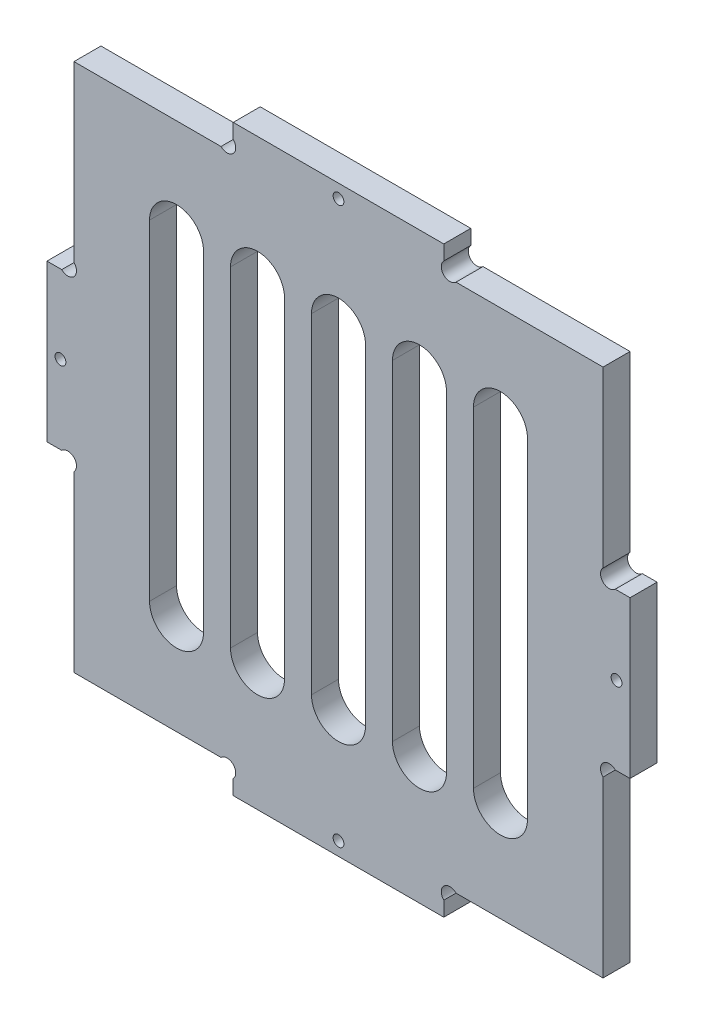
ISO-10303-21;
HEADER;
FILE_DESCRIPTION(('STEP AP214'),'2;1');
FILE_NAME('part.step','',(''),(''),'','','');
FILE_SCHEMA(('AUTOMOTIVE_DESIGN { 1 0 10303 214 1 1 1 1 }'));
ENDSEC;
DATA;
#1=APPLICATION_CONTEXT('core data for automotive mechanical design processes');
#2=APPLICATION_PROTOCOL_DEFINITION('international standard','automotive_design',2000,#1);
#3=PRODUCT_CONTEXT('',#1,'mechanical');
#4=PRODUCT('Part','Part','',(#3));
#5=PRODUCT_RELATED_PRODUCT_CATEGORY('part','',(#4));
#6=PRODUCT_DEFINITION_FORMATION('','',#4);
#7=PRODUCT_DEFINITION_CONTEXT('part definition',#1,'design');
#8=PRODUCT_DEFINITION('design','',#6,#7);
#9=PRODUCT_DEFINITION_SHAPE('','',#8);
#10=(LENGTH_UNIT() NAMED_UNIT(*) SI_UNIT(.MILLI.,.METRE.));
#11=(NAMED_UNIT(*) PLANE_ANGLE_UNIT() SI_UNIT($,.RADIAN.));
#12=(NAMED_UNIT(*) SI_UNIT($,.STERADIAN.) SOLID_ANGLE_UNIT());
#13=UNCERTAINTY_MEASURE_WITH_UNIT(LENGTH_MEASURE(1.E-05),#10,'distance_accuracy_value','');
#14=(GEOMETRIC_REPRESENTATION_CONTEXT(3) GLOBAL_UNCERTAINTY_ASSIGNED_CONTEXT((#13)) GLOBAL_UNIT_ASSIGNED_CONTEXT((#10,
#11,#12)) REPRESENTATION_CONTEXT('',''));
#15=CARTESIAN_POINT('',(0.,0.,0.));
#16=DIRECTION('',(0.,0.,1.));
#17=DIRECTION('',(1.,0.,0.));
#18=AXIS2_PLACEMENT_3D('',#15,#16,#17);
#19=CARTESIAN_POINT('',(72.3779323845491,-37.186148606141,5.));
#20=DIRECTION('',(0.,0.,1.));
#21=DIRECTION('',(1.,0.,0.));
#22=AXIS2_PLACEMENT_3D('',#19,#20,#21);
#23=PLANE('',#22);
#24=DIRECTION('',(0.,1.,0.));
#25=VECTOR('',#24,1.);
#26=CARTESIAN_POINT('',(12.2465615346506,9.01522224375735,5.));
#27=LINE('',#26,#25);
#28=CARTESIAN_POINT('',(12.2465615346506,-52.1247777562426,5.));
#29=VERTEX_POINT('',#28);
#30=CARTESIAN_POINT('',(12.2465615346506,9.01522224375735,5.));
#31=VERTEX_POINT('',#30);
#32=EDGE_CURVE('E375',#29,#31,#27,.T.);
#33=ORIENTED_EDGE('',*,*,#32,.F.);
#34=CARTESIAN_POINT('',(7.24656153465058,-52.1247777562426,5.));
#35=DIRECTION('',(0.,0.,1.));
#36=DIRECTION('',(1.,0.,0.));
#37=AXIS2_PLACEMENT_3D('',#34,#35,#36);
#38=CIRCLE('',#37,5.);
#39=CARTESIAN_POINT('',(2.24656153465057,-52.1247777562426,5.));
#40=VERTEX_POINT('',#39);
#41=EDGE_CURVE('E373',#40,#29,#38,.T.);
#42=ORIENTED_EDGE('',*,*,#41,.F.);
#43=DIRECTION('',(0.,-1.,0.));
#44=VECTOR('',#43,1.);
#45=CARTESIAN_POINT('',(2.24656153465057,9.01522224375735,5.));
#46=LINE('',#45,#44);
#47=CARTESIAN_POINT('',(2.24656153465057,9.01522224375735,5.));
#48=VERTEX_POINT('',#47);
#49=EDGE_CURVE('E381',#48,#40,#46,.T.);
#50=ORIENTED_EDGE('',*,*,#49,.F.);
#51=CARTESIAN_POINT('',(7.24656153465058,9.01522224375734,5.));
#52=DIRECTION('',(0.,0.,1.));
#53=DIRECTION('',(-1.,0.,0.));
#54=AXIS2_PLACEMENT_3D('',#51,#52,#53);
#55=CIRCLE('',#54,5.);
#56=EDGE_CURVE('E378',#31,#48,#55,.T.);
#57=ORIENTED_EDGE('',*,*,#56,.F.);
#58=EDGE_LOOP('',(#33,#42,#50,#57));
#59=FACE_BOUND('',#58,.T.);
#60=DIRECTION('',(0.,1.,0.));
#61=VECTOR('',#60,1.);
#62=CARTESIAN_POINT('',(42.2465615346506,9.01522224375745,5.));
#63=LINE('',#62,#61);
#64=CARTESIAN_POINT('',(42.2465615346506,-52.1247777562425,5.));
#65=VERTEX_POINT('',#64);
#66=CARTESIAN_POINT('',(42.2465615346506,9.01522224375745,5.));
#67=VERTEX_POINT('',#66);
#68=EDGE_CURVE('E437',#65,#67,#63,.T.);
#69=ORIENTED_EDGE('',*,*,#68,.F.);
#70=CARTESIAN_POINT('',(37.2465615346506,-52.1247777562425,5.));
#71=DIRECTION('',(0.,0.,1.));
#72=DIRECTION('',(1.,0.,0.));
#73=AXIS2_PLACEMENT_3D('',#70,#71,#72);
#74=CIRCLE('',#73,5.);
#75=CARTESIAN_POINT('',(32.2465615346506,-52.1247777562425,5.));
#76=VERTEX_POINT('',#75);
#77=EDGE_CURVE('E435',#76,#65,#74,.T.);
#78=ORIENTED_EDGE('',*,*,#77,.F.);
#79=DIRECTION('',(0.,-1.,0.));
#80=VECTOR('',#79,1.);
#81=CARTESIAN_POINT('',(32.2465615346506,9.01522224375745,5.));
#82=LINE('',#81,#80);
#83=CARTESIAN_POINT('',(32.2465615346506,9.01522224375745,5.));
#84=VERTEX_POINT('',#83);
#85=EDGE_CURVE('E443',#84,#76,#82,.T.);
#86=ORIENTED_EDGE('',*,*,#85,.F.);
#87=CARTESIAN_POINT('',(37.2465615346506,9.01522224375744,5.));
#88=DIRECTION('',(0.,0.,1.));
#89=DIRECTION('',(-1.,0.,0.));
#90=AXIS2_PLACEMENT_3D('',#87,#88,#89);
#91=CIRCLE('',#90,5.);
#92=EDGE_CURVE('E440',#67,#84,#91,.T.);
#93=ORIENTED_EDGE('',*,*,#92,.F.);
#94=EDGE_LOOP('',(#69,#78,#86,#93));
#95=FACE_BOUND('',#94,.T.);
#96=CARTESIAN_POINT('',(22.2465615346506,29.9452222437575,5.));
#97=DIRECTION('',(0.,0.,1.));
#98=DIRECTION('',(-1.,0.,0.));
#99=AXIS2_PLACEMENT_3D('',#96,#97,#98);
#100=CIRCLE('',#99,1.);
#101=CARTESIAN_POINT('',(21.2465615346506,29.9452222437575,5.));
#102=VERTEX_POINT('',#101);
#103=EDGE_CURVE('E497',#102,#102,#100,.T.);
#104=ORIENTED_EDGE('',*,*,#103,.F.);
#105=EDGE_LOOP('',(#104));
#106=FACE_BOUND('',#105,.T.);
#107=CARTESIAN_POINT('',(22.2465615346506,-73.0547777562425,5.));
#108=DIRECTION('',(0.,0.,1.));
#109=DIRECTION('',(1.,0.,0.));
#110=AXIS2_PLACEMENT_3D('',#107,#108,#109);
#111=CIRCLE('',#110,1.);
#112=CARTESIAN_POINT('',(23.2465615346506,-73.0547777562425,5.));
#113=VERTEX_POINT('',#112);
#114=EDGE_CURVE('E509',#113,#113,#111,.T.);
#115=ORIENTED_EDGE('',*,*,#114,.F.);
#116=EDGE_LOOP('',(#115));
#117=FACE_BOUND('',#116,.T.);
#118=CARTESIAN_POINT('',(72.3779323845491,-37.186148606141,5.));
#119=DIRECTION('',(0.,0.,-1.));
#120=DIRECTION('',(1.,0.,0.));
#121=AXIS2_PLACEMENT_3D('',#118,#119,#120);
#122=CIRCLE('',#121,1.59999999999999);
#123=CARTESIAN_POINT('',(71.2465615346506,-38.3175194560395,5.));
#124=VERTEX_POINT('',#123);
#125=CARTESIAN_POINT('',(73.5093032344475,-36.0547777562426,5.));
#126=VERTEX_POINT('',#125);
#127=EDGE_CURVE('E521',#124,#126,#122,.T.);
#128=ORIENTED_EDGE('',*,*,#127,.T.);
#129=DIRECTION('',(1.,0.,0.));
#130=VECTOR('',#129,1.);
#131=CARTESIAN_POINT('',(73.5093032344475,-36.0547777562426,5.));
#132=LINE('',#131,#130);
#133=CARTESIAN_POINT('',(76.2465615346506,-36.0547777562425,5.));
#134=VERTEX_POINT('',#133);
#135=EDGE_CURVE('E524',#126,#134,#132,.T.);
#136=ORIENTED_EDGE('',*,*,#135,.T.);
#137=DIRECTION('',(0.,1.,0.));
#138=VECTOR('',#137,1.);
#139=CARTESIAN_POINT('',(76.2465615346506,-7.05477775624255,5.));
#140=LINE('',#139,#138);
#141=CARTESIAN_POINT('',(76.2465615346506,-7.05477775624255,5.));
#142=VERTEX_POINT('',#141);
#143=EDGE_CURVE('E527',#134,#142,#140,.T.);
#144=ORIENTED_EDGE('',*,*,#143,.T.);
#145=DIRECTION('',(-1.,0.,0.));
#146=VECTOR('',#145,1.);
#147=CARTESIAN_POINT('',(73.5093032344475,-7.05477775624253,5.));
#148=LINE('',#147,#146);
#149=CARTESIAN_POINT('',(73.5093032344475,-7.05477775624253,5.));
#150=VERTEX_POINT('',#149);
#151=EDGE_CURVE('E529',#142,#150,#148,.T.);
#152=ORIENTED_EDGE('',*,*,#151,.T.);
#153=CARTESIAN_POINT('',(72.3779323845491,-5.92340690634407,5.));
#154=DIRECTION('',(0.,0.,-1.));
#155=DIRECTION('',(-1.,0.,0.));
#156=AXIS2_PLACEMENT_3D('',#153,#154,#155);
#157=CIRCLE('',#156,1.59999999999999);
#158=CARTESIAN_POINT('',(71.2465615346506,-4.79203605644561,5.));
#159=VERTEX_POINT('',#158);
#160=EDGE_CURVE('E531',#150,#159,#157,.T.);
#161=ORIENTED_EDGE('',*,*,#160,.T.);
#162=DIRECTION('',(0.,1.,0.));
#163=VECTOR('',#162,1.);
#164=CARTESIAN_POINT('',(71.2465615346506,-4.79203605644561,5.));
#165=LINE('',#164,#163);
#166=CARTESIAN_POINT('',(71.2465615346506,27.4452222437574,5.));
#167=VERTEX_POINT('',#166);
#168=EDGE_CURVE('E533',#159,#167,#165,.T.);
#169=ORIENTED_EDGE('',*,*,#168,.T.);
#170=DIRECTION('',(-1.,0.,0.));
#171=VECTOR('',#170,1.);
#172=CARTESIAN_POINT('',(71.2465615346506,27.4452222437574,5.));
#173=LINE('',#172,#171);
#174=CARTESIAN_POINT('',(44.0093032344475,27.4452222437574,5.));
#175=VERTEX_POINT('',#174);
#176=EDGE_CURVE('E535',#167,#175,#173,.T.);
#177=ORIENTED_EDGE('',*,*,#176,.T.);
#178=CARTESIAN_POINT('',(42.877932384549,28.5765930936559,5.));
#179=DIRECTION('',(0.,0.,-1.));
#180=DIRECTION('',(-1.,0.,0.));
#181=AXIS2_PLACEMENT_3D('',#178,#179,#180);
#182=CIRCLE('',#181,1.59999999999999);
#183=CARTESIAN_POINT('',(41.7465615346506,29.7079639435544,5.));
#184=VERTEX_POINT('',#183);
#185=EDGE_CURVE('E537',#175,#184,#182,.T.);
#186=ORIENTED_EDGE('',*,*,#185,.T.);
#187=DIRECTION('',(0.,1.,0.));
#188=VECTOR('',#187,1.);
#189=CARTESIAN_POINT('',(41.7465615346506,29.7079639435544,5.));
#190=LINE('',#189,#188);
#191=CARTESIAN_POINT('',(41.7465615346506,32.4452222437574,5.));
#192=VERTEX_POINT('',#191);
#193=EDGE_CURVE('E539',#184,#192,#190,.T.);
#194=ORIENTED_EDGE('',*,*,#193,.T.);
#195=DIRECTION('',(-1.,0.,0.));
#196=VECTOR('',#195,1.);
#197=CARTESIAN_POINT('',(2.74656153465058,32.4452222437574,5.));
#198=LINE('',#197,#196);
#199=CARTESIAN_POINT('',(2.74656153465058,32.4452222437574,5.));
#200=VERTEX_POINT('',#199);
#201=EDGE_CURVE('E541',#192,#200,#198,.T.);
#202=ORIENTED_EDGE('',*,*,#201,.T.);
#203=DIRECTION('',(0.,-1.,0.));
#204=VECTOR('',#203,1.);
#205=CARTESIAN_POINT('',(2.74656153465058,29.7079639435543,5.));
#206=LINE('',#205,#204);
#207=CARTESIAN_POINT('',(2.74656153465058,29.7079639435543,5.));
#208=VERTEX_POINT('',#207);
#209=EDGE_CURVE('E543',#200,#208,#206,.T.);
#210=ORIENTED_EDGE('',*,*,#209,.T.);
#211=CARTESIAN_POINT('',(1.61519068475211,28.5765930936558,5.));
#212=DIRECTION('',(0.,0.,-1.));
#213=DIRECTION('',(1.,0.,0.));
#214=AXIS2_PLACEMENT_3D('',#211,#212,#213);
#215=CIRCLE('',#214,1.59999999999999);
#216=CARTESIAN_POINT('',(0.483819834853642,27.4452222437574,5.));
#217=VERTEX_POINT('',#216);
#218=EDGE_CURVE('E545',#208,#217,#215,.T.);
#219=ORIENTED_EDGE('',*,*,#218,.T.);
#220=DIRECTION('',(-1.,0.,0.));
#221=VECTOR('',#220,1.);
#222=CARTESIAN_POINT('',(-26.7534384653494,27.4452222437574,5.));
#223=LINE('',#222,#221);
#224=CARTESIAN_POINT('',(-26.7534384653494,27.4452222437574,5.));
#225=VERTEX_POINT('',#224);
#226=EDGE_CURVE('E547',#217,#225,#223,.T.);
#227=ORIENTED_EDGE('',*,*,#226,.T.);
#228=DIRECTION('',(0.,-1.,0.));
#229=VECTOR('',#228,1.);
#230=CARTESIAN_POINT('',(-26.7534384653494,-4.79203605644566,5.));
#231=LINE('',#230,#229);
#232=CARTESIAN_POINT('',(-26.7534384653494,-4.79203605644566,5.));
#233=VERTEX_POINT('',#232);
#234=EDGE_CURVE('E549',#225,#233,#231,.T.);
#235=ORIENTED_EDGE('',*,*,#234,.T.);
#236=CARTESIAN_POINT('',(-27.8848093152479,-5.92340690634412,5.));
#237=DIRECTION('',(0.,0.,-1.));
#238=DIRECTION('',(1.,0.,0.));
#239=AXIS2_PLACEMENT_3D('',#236,#237,#238);
#240=CIRCLE('',#239,1.59999999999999);
#241=CARTESIAN_POINT('',(-29.0161801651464,-7.05477775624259,5.));
#242=VERTEX_POINT('',#241);
#243=EDGE_CURVE('E551',#233,#242,#240,.T.);
#244=ORIENTED_EDGE('',*,*,#243,.T.);
#245=DIRECTION('',(-1.,0.,0.));
#246=VECTOR('',#245,1.);
#247=CARTESIAN_POINT('',(-29.0161801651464,-7.05477775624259,5.));
#248=LINE('',#247,#246);
#249=CARTESIAN_POINT('',(-31.7534384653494,-7.0547777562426,5.));
#250=VERTEX_POINT('',#249);
#251=EDGE_CURVE('E553',#242,#250,#248,.T.);
#252=ORIENTED_EDGE('',*,*,#251,.T.);
#253=DIRECTION('',(0.,-1.,0.));
#254=VECTOR('',#253,1.);
#255=CARTESIAN_POINT('',(-31.7534384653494,-36.0547777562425,5.));
#256=LINE('',#255,#254);
#257=CARTESIAN_POINT('',(-31.7534384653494,-36.0547777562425,5.));
#258=VERTEX_POINT('',#257);
#259=EDGE_CURVE('E555',#250,#258,#256,.T.);
#260=ORIENTED_EDGE('',*,*,#259,.T.);
#261=DIRECTION('',(1.,0.,0.));
#262=VECTOR('',#261,1.);
#263=CARTESIAN_POINT('',(-29.0161801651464,-36.0547777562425,5.));
#264=LINE('',#263,#262);
#265=CARTESIAN_POINT('',(-29.0161801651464,-36.0547777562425,5.));
#266=VERTEX_POINT('',#265);
#267=EDGE_CURVE('E557',#258,#266,#264,.T.);
#268=ORIENTED_EDGE('',*,*,#267,.T.);
#269=CARTESIAN_POINT('',(-27.8848093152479,-37.186148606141,5.));
#270=DIRECTION('',(0.,0.,-1.));
#271=DIRECTION('',(-1.,0.,0.));
#272=AXIS2_PLACEMENT_3D('',#269,#270,#271);
#273=CIRCLE('',#272,1.59999999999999);
#274=CARTESIAN_POINT('',(-26.7534384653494,-38.3175194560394,5.));
#275=VERTEX_POINT('',#274);
#276=EDGE_CURVE('E559',#266,#275,#273,.T.);
#277=ORIENTED_EDGE('',*,*,#276,.T.);
#278=DIRECTION('',(0.,-1.,0.));
#279=VECTOR('',#278,1.);
#280=CARTESIAN_POINT('',(-26.7534384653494,-38.3175194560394,5.));
#281=LINE('',#280,#279);
#282=CARTESIAN_POINT('',(-26.7534384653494,-70.5547777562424,5.));
#283=VERTEX_POINT('',#282);
#284=EDGE_CURVE('E561',#275,#283,#281,.T.);
#285=ORIENTED_EDGE('',*,*,#284,.T.);
#286=DIRECTION('',(1.,0.,0.));
#287=VECTOR('',#286,1.);
#288=CARTESIAN_POINT('',(-26.7534384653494,-70.5547777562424,5.));
#289=LINE('',#288,#287);
#290=CARTESIAN_POINT('',(0.483819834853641,-70.5547777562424,5.));
#291=VERTEX_POINT('',#290);
#292=EDGE_CURVE('E563',#283,#291,#289,.T.);
#293=ORIENTED_EDGE('',*,*,#292,.T.);
#294=CARTESIAN_POINT('',(1.61519068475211,-71.6861486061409,5.));
#295=DIRECTION('',(0.,0.,-1.));
#296=DIRECTION('',(-1.,0.,0.));
#297=AXIS2_PLACEMENT_3D('',#294,#295,#296);
#298=CIRCLE('',#297,1.59999999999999);
#299=CARTESIAN_POINT('',(2.74656153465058,-72.8175194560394,5.));
#300=VERTEX_POINT('',#299);
#301=EDGE_CURVE('E565',#291,#300,#298,.T.);
#302=ORIENTED_EDGE('',*,*,#301,.T.);
#303=DIRECTION('',(0.,-1.,0.));
#304=VECTOR('',#303,1.);
#305=CARTESIAN_POINT('',(2.74656153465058,-72.8175194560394,5.));
#306=LINE('',#305,#304);
#307=CARTESIAN_POINT('',(2.74656153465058,-75.5547777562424,5.));
#308=VERTEX_POINT('',#307);
#309=EDGE_CURVE('E567',#300,#308,#306,.T.);
#310=ORIENTED_EDGE('',*,*,#309,.T.);
#311=DIRECTION('',(1.,0.,0.));
#312=VECTOR('',#311,1.);
#313=CARTESIAN_POINT('',(2.74656153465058,-75.5547777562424,5.));
#314=LINE('',#313,#312);
#315=CARTESIAN_POINT('',(41.7465615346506,-75.5547777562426,5.));
#316=VERTEX_POINT('',#315);
#317=EDGE_CURVE('E569',#308,#316,#314,.T.);
#318=ORIENTED_EDGE('',*,*,#317,.T.);
#319=DIRECTION('',(0.,1.,0.));
#320=VECTOR('',#319,1.);
#321=CARTESIAN_POINT('',(41.7465615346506,-72.8175194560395,5.));
#322=LINE('',#321,#320);
#323=CARTESIAN_POINT('',(41.7465615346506,-72.8175194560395,5.));
#324=VERTEX_POINT('',#323);
#325=EDGE_CURVE('E571',#316,#324,#322,.T.);
#326=ORIENTED_EDGE('',*,*,#325,.T.);
#327=CARTESIAN_POINT('',(42.877932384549,-71.686148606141,5.));
#328=DIRECTION('',(0.,0.,-1.));
#329=DIRECTION('',(1.,0.,0.));
#330=AXIS2_PLACEMENT_3D('',#327,#328,#329);
#331=CIRCLE('',#330,1.59999999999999);
#332=CARTESIAN_POINT('',(44.0093032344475,-70.5547777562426,5.));
#333=VERTEX_POINT('',#332);
#334=EDGE_CURVE('E573',#324,#333,#331,.T.);
#335=ORIENTED_EDGE('',*,*,#334,.T.);
#336=DIRECTION('',(1.,0.,0.));
#337=VECTOR('',#336,1.);
#338=CARTESIAN_POINT('',(71.2465615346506,-70.5547777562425,5.));
#339=LINE('',#338,#337);
#340=CARTESIAN_POINT('',(71.2465615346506,-70.5547777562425,5.));
#341=VERTEX_POINT('',#340);
#342=EDGE_CURVE('E575',#333,#341,#339,.T.);
#343=ORIENTED_EDGE('',*,*,#342,.T.);
#344=DIRECTION('',(0.,1.,0.));
#345=VECTOR('',#344,1.);
#346=CARTESIAN_POINT('',(71.2465615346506,-38.3175194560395,5.));
#347=LINE('',#346,#345);
#348=EDGE_CURVE('E577',#341,#124,#347,.T.);
#349=ORIENTED_EDGE('',*,*,#348,.T.);
#350=EDGE_LOOP('',(#128,#136,#144,#152,#161,#169,#177,#186,#194,#202,#210,#219,#227,#235,#244,
#252,#260,#268,#277,#285,#293,#302,#310,#318,#326,#335,#343,#349));
#351=FACE_BOUND('',#350,.T.);
#352=CARTESIAN_POINT('',(73.7465615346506,-21.5547777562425,5.));
#353=DIRECTION('',(0.,0.,1.));
#354=DIRECTION('',(1.,0.,0.));
#355=AXIS2_PLACEMENT_3D('',#352,#353,#354);
#356=CIRCLE('',#355,0.999999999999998);
#357=CARTESIAN_POINT('',(74.7465615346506,-21.5547777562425,5.));
#358=VERTEX_POINT('',#357);
#359=EDGE_CURVE('E515',#358,#358,#356,.T.);
#360=ORIENTED_EDGE('',*,*,#359,.F.);
#361=EDGE_LOOP('',(#360));
#362=FACE_BOUND('',#361,.T.);
#363=CARTESIAN_POINT('',(-29.2534384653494,-21.5547777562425,5.));
#364=DIRECTION('',(0.,0.,1.));
#365=DIRECTION('',(-1.,0.,0.));
#366=AXIS2_PLACEMENT_3D('',#363,#364,#365);
#367=CIRCLE('',#366,0.999999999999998);
#368=CARTESIAN_POINT('',(-30.2534384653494,-21.5547777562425,5.));
#369=VERTEX_POINT('',#368);
#370=EDGE_CURVE('E503',#369,#369,#367,.T.);
#371=ORIENTED_EDGE('',*,*,#370,.F.);
#372=EDGE_LOOP('',(#371));
#373=FACE_BOUND('',#372,.T.);
#374=DIRECTION('',(0.,1.,0.));
#375=VECTOR('',#374,1.);
#376=CARTESIAN_POINT('',(27.2465615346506,9.01522224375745,5.));
#377=LINE('',#376,#375);
#378=CARTESIAN_POINT('',(27.2465615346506,-52.1247777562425,5.));
#379=VERTEX_POINT('',#378);
#380=CARTESIAN_POINT('',(27.2465615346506,9.01522224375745,5.));
#381=VERTEX_POINT('',#380);
#382=EDGE_CURVE('E468',#379,#381,#377,.T.);
#383=ORIENTED_EDGE('',*,*,#382,.F.);
#384=CARTESIAN_POINT('',(22.2465615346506,-52.1247777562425,5.));
#385=DIRECTION('',(0.,0.,1.));
#386=DIRECTION('',(1.,0.,0.));
#387=AXIS2_PLACEMENT_3D('',#384,#385,#386);
#388=CIRCLE('',#387,5.);
#389=CARTESIAN_POINT('',(17.2465615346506,-52.1247777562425,5.));
#390=VERTEX_POINT('',#389);
#391=EDGE_CURVE('E466',#390,#379,#388,.T.);
#392=ORIENTED_EDGE('',*,*,#391,.F.);
#393=DIRECTION('',(0.,-1.,0.));
#394=VECTOR('',#393,1.);
#395=CARTESIAN_POINT('',(17.2465615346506,9.01522224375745,5.));
#396=LINE('',#395,#394);
#397=CARTESIAN_POINT('',(17.2465615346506,9.01522224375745,5.));
#398=VERTEX_POINT('',#397);
#399=EDGE_CURVE('E474',#398,#390,#396,.T.);
#400=ORIENTED_EDGE('',*,*,#399,.F.);
#401=CARTESIAN_POINT('',(22.2465615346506,9.01522224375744,5.));
#402=DIRECTION('',(0.,0.,1.));
#403=DIRECTION('',(-1.,0.,0.));
#404=AXIS2_PLACEMENT_3D('',#401,#402,#403);
#405=CIRCLE('',#404,5.);
#406=EDGE_CURVE('E471',#381,#398,#405,.T.);
#407=ORIENTED_EDGE('',*,*,#406,.F.);
#408=EDGE_LOOP('',(#383,#392,#400,#407));
#409=FACE_BOUND('',#408,.T.);
#410=DIRECTION('',(0.,1.,0.));
#411=VECTOR('',#410,1.);
#412=CARTESIAN_POINT('',(57.2465615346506,9.01522224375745,5.));
#413=LINE('',#412,#411);
#414=CARTESIAN_POINT('',(57.2465615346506,-52.1247777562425,5.));
#415=VERTEX_POINT('',#414);
#416=CARTESIAN_POINT('',(57.2465615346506,9.01522224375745,5.));
#417=VERTEX_POINT('',#416);
#418=EDGE_CURVE('E406',#415,#417,#413,.T.);
#419=ORIENTED_EDGE('',*,*,#418,.F.);
#420=CARTESIAN_POINT('',(52.2465615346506,-52.1247777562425,5.));
#421=DIRECTION('',(0.,0.,1.));
#422=DIRECTION('',(1.,0.,0.));
#423=AXIS2_PLACEMENT_3D('',#420,#421,#422);
#424=CIRCLE('',#423,5.);
#425=CARTESIAN_POINT('',(47.2465615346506,-52.1247777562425,5.));
#426=VERTEX_POINT('',#425);
#427=EDGE_CURVE('E404',#426,#415,#424,.T.);
#428=ORIENTED_EDGE('',*,*,#427,.F.);
#429=DIRECTION('',(0.,-1.,0.));
#430=VECTOR('',#429,1.);
#431=CARTESIAN_POINT('',(47.2465615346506,9.01522224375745,5.));
#432=LINE('',#431,#430);
#433=CARTESIAN_POINT('',(47.2465615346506,9.01522224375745,5.));
#434=VERTEX_POINT('',#433);
#435=EDGE_CURVE('E412',#434,#426,#432,.T.);
#436=ORIENTED_EDGE('',*,*,#435,.F.);
#437=CARTESIAN_POINT('',(52.2465615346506,9.01522224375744,5.));
#438=DIRECTION('',(0.,0.,1.));
#439=DIRECTION('',(-1.,0.,0.));
#440=AXIS2_PLACEMENT_3D('',#437,#438,#439);
#441=CIRCLE('',#440,5.);
#442=EDGE_CURVE('E409',#417,#434,#441,.T.);
#443=ORIENTED_EDGE('',*,*,#442,.F.);
#444=EDGE_LOOP('',(#419,#428,#436,#443));
#445=FACE_BOUND('',#444,.T.);
#446=DIRECTION('',(0.,1.,0.));
#447=VECTOR('',#446,1.);
#448=CARTESIAN_POINT('',(-2.75343846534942,9.01522224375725,5.));
#449=LINE('',#448,#447);
#450=CARTESIAN_POINT('',(-2.75343846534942,-52.1247777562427,5.));
#451=VERTEX_POINT('',#450);
#452=CARTESIAN_POINT('',(-2.75343846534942,9.01522224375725,5.));
#453=VERTEX_POINT('',#452);
#454=EDGE_CURVE('E345',#451,#453,#449,.T.);
#455=ORIENTED_EDGE('',*,*,#454,.F.);
#456=CARTESIAN_POINT('',(-7.75343846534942,-52.1247777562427,5.));
#457=DIRECTION('',(0.,0.,1.));
#458=DIRECTION('',(1.,0.,0.));
#459=AXIS2_PLACEMENT_3D('',#456,#457,#458);
#460=CIRCLE('',#459,5.);
#461=CARTESIAN_POINT('',(-12.7534384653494,-52.1247777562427,5.));
#462=VERTEX_POINT('',#461);
#463=EDGE_CURVE('E337',#462,#451,#460,.T.);
#464=ORIENTED_EDGE('',*,*,#463,.F.);
#465=DIRECTION('',(0.,-1.,0.));
#466=VECTOR('',#465,1.);
#467=CARTESIAN_POINT('',(-12.7534384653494,9.01522224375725,5.));
#468=LINE('',#467,#466);
#469=CARTESIAN_POINT('',(-12.7534384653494,9.01522224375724,5.));
#470=VERTEX_POINT('',#469);
#471=EDGE_CURVE('E359',#470,#462,#468,.T.);
#472=ORIENTED_EDGE('',*,*,#471,.F.);
#473=CARTESIAN_POINT('',(-7.75343846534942,9.01522224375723,5.));
#474=DIRECTION('',(0.,0.,1.));
#475=DIRECTION('',(-1.,0.,0.));
#476=AXIS2_PLACEMENT_3D('',#473,#474,#475);
#477=CIRCLE('',#476,5.);
#478=EDGE_CURVE('E357',#453,#470,#477,.T.);
#479=ORIENTED_EDGE('',*,*,#478,.F.);
#480=EDGE_LOOP('',(#455,#464,#472,#479));
#481=FACE_BOUND('',#480,.T.);
#482=ADVANCED_FACE('F32',(#59,#95,#106,#117,#351,#362,#373,#409,#445,#481),#23,.T.);
#483=CARTESIAN_POINT('',(72.3779323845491,-37.186148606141,0.));
#484=DIRECTION('',(0.,0.,1.));
#485=DIRECTION('',(1.,0.,0.));
#486=AXIS2_PLACEMENT_3D('',#483,#484,#485);
#487=PLANE('',#486);
#488=CARTESIAN_POINT('',(7.24656153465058,-52.1247777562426,0.));
#489=DIRECTION('',(0.,0.,1.));
#490=DIRECTION('',(1.,0.,0.));
#491=AXIS2_PLACEMENT_3D('',#488,#489,#490);
#492=CIRCLE('',#491,5.);
#493=CARTESIAN_POINT('',(2.24656153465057,-52.1247777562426,0.));
#494=VERTEX_POINT('',#493);
#495=CARTESIAN_POINT('',(12.2465615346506,-52.1247777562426,0.));
#496=VERTEX_POINT('',#495);
#497=EDGE_CURVE('E353',#494,#496,#492,.T.);
#498=ORIENTED_EDGE('',*,*,#497,.T.);
#499=DIRECTION('',(0.,1.,0.));
#500=VECTOR('',#499,1.);
#501=CARTESIAN_POINT('',(12.2465615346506,9.01522224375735,0.));
#502=LINE('',#501,#500);
#503=CARTESIAN_POINT('',(12.2465615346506,9.01522224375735,0.));
#504=VERTEX_POINT('',#503);
#505=EDGE_CURVE('E386',#496,#504,#502,.T.);
#506=ORIENTED_EDGE('',*,*,#505,.T.);
#507=CARTESIAN_POINT('',(7.24656153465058,9.01522224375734,0.));
#508=DIRECTION('',(0.,0.,1.));
#509=DIRECTION('',(-1.,0.,0.));
#510=AXIS2_PLACEMENT_3D('',#507,#508,#509);
#511=CIRCLE('',#510,5.);
#512=CARTESIAN_POINT('',(2.24656153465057,9.01522224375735,0.));
#513=VERTEX_POINT('',#512);
#514=EDGE_CURVE('E389',#504,#513,#511,.T.);
#515=ORIENTED_EDGE('',*,*,#514,.T.);
#516=DIRECTION('',(0.,-1.,0.));
#517=VECTOR('',#516,1.);
#518=CARTESIAN_POINT('',(2.24656153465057,9.01522224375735,0.));
#519=LINE('',#518,#517);
#520=EDGE_CURVE('E376',#513,#494,#519,.T.);
#521=ORIENTED_EDGE('',*,*,#520,.T.);
#522=EDGE_LOOP('',(#498,#506,#515,#521));
#523=FACE_BOUND('',#522,.T.);
#524=CARTESIAN_POINT('',(37.2465615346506,-52.1247777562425,0.));
#525=DIRECTION('',(0.,0.,1.));
#526=DIRECTION('',(1.,0.,0.));
#527=AXIS2_PLACEMENT_3D('',#524,#525,#526);
#528=CIRCLE('',#527,5.);
#529=CARTESIAN_POINT('',(32.2465615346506,-52.1247777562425,0.));
#530=VERTEX_POINT('',#529);
#531=CARTESIAN_POINT('',(42.2465615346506,-52.1247777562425,0.));
#532=VERTEX_POINT('',#531);
#533=EDGE_CURVE('E434',#530,#532,#528,.T.);
#534=ORIENTED_EDGE('',*,*,#533,.T.);
#535=DIRECTION('',(0.,1.,0.));
#536=VECTOR('',#535,1.);
#537=CARTESIAN_POINT('',(42.2465615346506,9.01522224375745,0.));
#538=LINE('',#537,#536);
#539=CARTESIAN_POINT('',(42.2465615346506,9.01522224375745,0.));
#540=VERTEX_POINT('',#539);
#541=EDGE_CURVE('E448',#532,#540,#538,.T.);
#542=ORIENTED_EDGE('',*,*,#541,.T.);
#543=CARTESIAN_POINT('',(37.2465615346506,9.01522224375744,0.));
#544=DIRECTION('',(0.,0.,1.));
#545=DIRECTION('',(-1.,0.,0.));
#546=AXIS2_PLACEMENT_3D('',#543,#544,#545);
#547=CIRCLE('',#546,5.);
#548=CARTESIAN_POINT('',(32.2465615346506,9.01522224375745,0.));
#549=VERTEX_POINT('',#548);
#550=EDGE_CURVE('E451',#540,#549,#547,.T.);
#551=ORIENTED_EDGE('',*,*,#550,.T.);
#552=DIRECTION('',(0.,-1.,0.));
#553=VECTOR('',#552,1.);
#554=CARTESIAN_POINT('',(32.2465615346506,9.01522224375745,0.));
#555=LINE('',#554,#553);
#556=EDGE_CURVE('E438',#549,#530,#555,.T.);
#557=ORIENTED_EDGE('',*,*,#556,.T.);
#558=EDGE_LOOP('',(#534,#542,#551,#557));
#559=FACE_BOUND('',#558,.T.);
#560=CARTESIAN_POINT('',(22.2465615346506,29.9452222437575,0.));
#561=DIRECTION('',(0.,0.,1.));
#562=DIRECTION('',(-1.,0.,0.));
#563=AXIS2_PLACEMENT_3D('',#560,#561,#562);
#564=CIRCLE('',#563,1.);
#565=CARTESIAN_POINT('',(21.2465615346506,29.9452222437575,0.));
#566=VERTEX_POINT('',#565);
#567=EDGE_CURVE('E496',#566,#566,#564,.T.);
#568=ORIENTED_EDGE('',*,*,#567,.T.);
#569=EDGE_LOOP('',(#568));
#570=FACE_BOUND('',#569,.T.);
#571=CARTESIAN_POINT('',(22.2465615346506,-73.0547777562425,0.));
#572=DIRECTION('',(0.,0.,1.));
#573=DIRECTION('',(1.,0.,0.));
#574=AXIS2_PLACEMENT_3D('',#571,#572,#573);
#575=CIRCLE('',#574,1.);
#576=CARTESIAN_POINT('',(23.2465615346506,-73.0547777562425,0.));
#577=VERTEX_POINT('',#576);
#578=EDGE_CURVE('E506',#577,#577,#575,.T.);
#579=ORIENTED_EDGE('',*,*,#578,.T.);
#580=EDGE_LOOP('',(#579));
#581=FACE_BOUND('',#580,.T.);
#582=CARTESIAN_POINT('',(72.3779323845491,-37.186148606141,0.));
#583=DIRECTION('',(0.,0.,-1.));
#584=DIRECTION('',(1.,0.,0.));
#585=AXIS2_PLACEMENT_3D('',#582,#583,#584);
#586=CIRCLE('',#585,1.59999999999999);
#587=CARTESIAN_POINT('',(71.2465615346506,-38.3175194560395,0.));
#588=VERTEX_POINT('',#587);
#589=CARTESIAN_POINT('',(73.5093032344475,-36.0547777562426,0.));
#590=VERTEX_POINT('',#589);
#591=EDGE_CURVE('E518',#588,#590,#586,.T.);
#592=ORIENTED_EDGE('',*,*,#591,.F.);
#593=DIRECTION('',(0.,1.,0.));
#594=VECTOR('',#593,1.);
#595=CARTESIAN_POINT('',(71.2465615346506,-38.3175194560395,0.));
#596=LINE('',#595,#594);
#597=CARTESIAN_POINT('',(71.2465615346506,-70.5547777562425,0.));
#598=VERTEX_POINT('',#597);
#599=EDGE_CURVE('E525',#598,#588,#596,.T.);
#600=ORIENTED_EDGE('',*,*,#599,.F.);
#601=DIRECTION('',(1.,0.,0.));
#602=VECTOR('',#601,1.);
#603=CARTESIAN_POINT('',(71.2465615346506,-70.5547777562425,0.));
#604=LINE('',#603,#602);
#605=CARTESIAN_POINT('',(44.0093032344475,-70.5547777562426,0.));
#606=VERTEX_POINT('',#605);
#607=EDGE_CURVE('E632',#606,#598,#604,.T.);
#608=ORIENTED_EDGE('',*,*,#607,.F.);
#609=CARTESIAN_POINT('',(42.877932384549,-71.686148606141,0.));
#610=DIRECTION('',(0.,0.,-1.));
#611=DIRECTION('',(1.,0.,0.));
#612=AXIS2_PLACEMENT_3D('',#609,#610,#611);
#613=CIRCLE('',#612,1.59999999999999);
#614=CARTESIAN_POINT('',(41.7465615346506,-72.8175194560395,0.));
#615=VERTEX_POINT('',#614);
#616=EDGE_CURVE('E630',#615,#606,#613,.T.);
#617=ORIENTED_EDGE('',*,*,#616,.F.);
#618=DIRECTION('',(0.,1.,0.));
#619=VECTOR('',#618,1.);
#620=CARTESIAN_POINT('',(41.7465615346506,-72.8175194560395,0.));
#621=LINE('',#620,#619);
#622=CARTESIAN_POINT('',(41.7465615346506,-75.5547777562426,0.));
#623=VERTEX_POINT('',#622);
#624=EDGE_CURVE('E628',#623,#615,#621,.T.);
#625=ORIENTED_EDGE('',*,*,#624,.F.);
#626=DIRECTION('',(1.,0.,0.));
#627=VECTOR('',#626,1.);
#628=CARTESIAN_POINT('',(2.74656153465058,-75.5547777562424,0.));
#629=LINE('',#628,#627);
#630=CARTESIAN_POINT('',(2.74656153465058,-75.5547777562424,0.));
#631=VERTEX_POINT('',#630);
#632=EDGE_CURVE('E626',#631,#623,#629,.T.);
#633=ORIENTED_EDGE('',*,*,#632,.F.);
#634=DIRECTION('',(0.,-1.,0.));
#635=VECTOR('',#634,1.);
#636=CARTESIAN_POINT('',(2.74656153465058,-72.8175194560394,0.));
#637=LINE('',#636,#635);
#638=CARTESIAN_POINT('',(2.74656153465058,-72.8175194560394,0.));
#639=VERTEX_POINT('',#638);
#640=EDGE_CURVE('E624',#639,#631,#637,.T.);
#641=ORIENTED_EDGE('',*,*,#640,.F.);
#642=CARTESIAN_POINT('',(1.61519068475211,-71.6861486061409,0.));
#643=DIRECTION('',(0.,0.,-1.));
#644=DIRECTION('',(-1.,0.,0.));
#645=AXIS2_PLACEMENT_3D('',#642,#643,#644);
#646=CIRCLE('',#645,1.59999999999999);
#647=CARTESIAN_POINT('',(0.483819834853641,-70.5547777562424,0.));
#648=VERTEX_POINT('',#647);
#649=EDGE_CURVE('E622',#648,#639,#646,.T.);
#650=ORIENTED_EDGE('',*,*,#649,.F.);
#651=DIRECTION('',(1.,0.,0.));
#652=VECTOR('',#651,1.);
#653=CARTESIAN_POINT('',(-26.7534384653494,-70.5547777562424,0.));
#654=LINE('',#653,#652);
#655=CARTESIAN_POINT('',(-26.7534384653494,-70.5547777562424,0.));
#656=VERTEX_POINT('',#655);
#657=EDGE_CURVE('E620',#656,#648,#654,.T.);
#658=ORIENTED_EDGE('',*,*,#657,.F.);
#659=DIRECTION('',(0.,-1.,0.));
#660=VECTOR('',#659,1.);
#661=CARTESIAN_POINT('',(-26.7534384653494,-38.3175194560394,0.));
#662=LINE('',#661,#660);
#663=CARTESIAN_POINT('',(-26.7534384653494,-38.3175194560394,0.));
#664=VERTEX_POINT('',#663);
#665=EDGE_CURVE('E618',#664,#656,#662,.T.);
#666=ORIENTED_EDGE('',*,*,#665,.F.);
#667=CARTESIAN_POINT('',(-27.8848093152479,-37.186148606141,0.));
#668=DIRECTION('',(0.,0.,-1.));
#669=DIRECTION('',(-1.,0.,0.));
#670=AXIS2_PLACEMENT_3D('',#667,#668,#669);
#671=CIRCLE('',#670,1.59999999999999);
#672=CARTESIAN_POINT('',(-29.0161801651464,-36.0547777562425,0.));
#673=VERTEX_POINT('',#672);
#674=EDGE_CURVE('E616',#673,#664,#671,.T.);
#675=ORIENTED_EDGE('',*,*,#674,.F.);
#676=DIRECTION('',(1.,0.,0.));
#677=VECTOR('',#676,1.);
#678=CARTESIAN_POINT('',(-29.0161801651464,-36.0547777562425,0.));
#679=LINE('',#678,#677);
#680=CARTESIAN_POINT('',(-31.7534384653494,-36.0547777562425,0.));
#681=VERTEX_POINT('',#680);
#682=EDGE_CURVE('E614',#681,#673,#679,.T.);
#683=ORIENTED_EDGE('',*,*,#682,.F.);
#684=DIRECTION('',(0.,-1.,0.));
#685=VECTOR('',#684,1.);
#686=CARTESIAN_POINT('',(-31.7534384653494,-36.0547777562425,0.));
#687=LINE('',#686,#685);
#688=CARTESIAN_POINT('',(-31.7534384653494,-7.0547777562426,0.));
#689=VERTEX_POINT('',#688);
#690=EDGE_CURVE('E612',#689,#681,#687,.T.);
#691=ORIENTED_EDGE('',*,*,#690,.F.);
#692=DIRECTION('',(-1.,0.,0.));
#693=VECTOR('',#692,1.);
#694=CARTESIAN_POINT('',(-29.0161801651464,-7.05477775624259,0.));
#695=LINE('',#694,#693);
#696=CARTESIAN_POINT('',(-29.0161801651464,-7.05477775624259,0.));
#697=VERTEX_POINT('',#696);
#698=EDGE_CURVE('E610',#697,#689,#695,.T.);
#699=ORIENTED_EDGE('',*,*,#698,.F.);
#700=CARTESIAN_POINT('',(-27.8848093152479,-5.92340690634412,0.));
#701=DIRECTION('',(0.,0.,-1.));
#702=DIRECTION('',(1.,0.,0.));
#703=AXIS2_PLACEMENT_3D('',#700,#701,#702);
#704=CIRCLE('',#703,1.59999999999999);
#705=CARTESIAN_POINT('',(-26.7534384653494,-4.79203605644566,0.));
#706=VERTEX_POINT('',#705);
#707=EDGE_CURVE('E608',#706,#697,#704,.T.);
#708=ORIENTED_EDGE('',*,*,#707,.F.);
#709=DIRECTION('',(0.,-1.,0.));
#710=VECTOR('',#709,1.);
#711=CARTESIAN_POINT('',(-26.7534384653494,-4.79203605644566,0.));
#712=LINE('',#711,#710);
#713=CARTESIAN_POINT('',(-26.7534384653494,27.4452222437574,0.));
#714=VERTEX_POINT('',#713);
#715=EDGE_CURVE('E606',#714,#706,#712,.T.);
#716=ORIENTED_EDGE('',*,*,#715,.F.);
#717=DIRECTION('',(-1.,0.,0.));
#718=VECTOR('',#717,1.);
#719=CARTESIAN_POINT('',(-26.7534384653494,27.4452222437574,0.));
#720=LINE('',#719,#718);
#721=CARTESIAN_POINT('',(0.483819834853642,27.4452222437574,0.));
#722=VERTEX_POINT('',#721);
#723=EDGE_CURVE('E604',#722,#714,#720,.T.);
#724=ORIENTED_EDGE('',*,*,#723,.F.);
#725=CARTESIAN_POINT('',(1.61519068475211,28.5765930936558,0.));
#726=DIRECTION('',(0.,0.,-1.));
#727=DIRECTION('',(1.,0.,0.));
#728=AXIS2_PLACEMENT_3D('',#725,#726,#727);
#729=CIRCLE('',#728,1.59999999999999);
#730=CARTESIAN_POINT('',(2.74656153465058,29.7079639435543,0.));
#731=VERTEX_POINT('',#730);
#732=EDGE_CURVE('E602',#731,#722,#729,.T.);
#733=ORIENTED_EDGE('',*,*,#732,.F.);
#734=DIRECTION('',(0.,-1.,0.));
#735=VECTOR('',#734,1.);
#736=CARTESIAN_POINT('',(2.74656153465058,29.7079639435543,0.));
#737=LINE('',#736,#735);
#738=CARTESIAN_POINT('',(2.74656153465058,32.4452222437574,0.));
#739=VERTEX_POINT('',#738);
#740=EDGE_CURVE('E600',#739,#731,#737,.T.);
#741=ORIENTED_EDGE('',*,*,#740,.F.);
#742=DIRECTION('',(-1.,0.,0.));
#743=VECTOR('',#742,1.);
#744=CARTESIAN_POINT('',(2.74656153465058,32.4452222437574,0.));
#745=LINE('',#744,#743);
#746=CARTESIAN_POINT('',(41.7465615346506,32.4452222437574,0.));
#747=VERTEX_POINT('',#746);
#748=EDGE_CURVE('E598',#747,#739,#745,.T.);
#749=ORIENTED_EDGE('',*,*,#748,.F.);
#750=DIRECTION('',(0.,1.,0.));
#751=VECTOR('',#750,1.);
#752=CARTESIAN_POINT('',(41.7465615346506,29.7079639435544,0.));
#753=LINE('',#752,#751);
#754=CARTESIAN_POINT('',(41.7465615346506,29.7079639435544,0.));
#755=VERTEX_POINT('',#754);
#756=EDGE_CURVE('E596',#755,#747,#753,.T.);
#757=ORIENTED_EDGE('',*,*,#756,.F.);
#758=CARTESIAN_POINT('',(42.877932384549,28.5765930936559,0.));
#759=DIRECTION('',(0.,0.,-1.));
#760=DIRECTION('',(-1.,0.,0.));
#761=AXIS2_PLACEMENT_3D('',#758,#759,#760);
#762=CIRCLE('',#761,1.59999999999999);
#763=CARTESIAN_POINT('',(44.0093032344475,27.4452222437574,0.));
#764=VERTEX_POINT('',#763);
#765=EDGE_CURVE('E594',#764,#755,#762,.T.);
#766=ORIENTED_EDGE('',*,*,#765,.F.);
#767=DIRECTION('',(-1.,0.,0.));
#768=VECTOR('',#767,1.);
#769=CARTESIAN_POINT('',(71.2465615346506,27.4452222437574,0.));
#770=LINE('',#769,#768);
#771=CARTESIAN_POINT('',(71.2465615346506,27.4452222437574,0.));
#772=VERTEX_POINT('',#771);
#773=EDGE_CURVE('E592',#772,#764,#770,.T.);
#774=ORIENTED_EDGE('',*,*,#773,.F.);
#775=DIRECTION('',(0.,1.,0.));
#776=VECTOR('',#775,1.);
#777=CARTESIAN_POINT('',(71.2465615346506,-4.79203605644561,0.));
#778=LINE('',#777,#776);
#779=CARTESIAN_POINT('',(71.2465615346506,-4.79203605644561,0.));
#780=VERTEX_POINT('',#779);
#781=EDGE_CURVE('E590',#780,#772,#778,.T.);
#782=ORIENTED_EDGE('',*,*,#781,.F.);
#783=CARTESIAN_POINT('',(72.3779323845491,-5.92340690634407,0.));
#784=DIRECTION('',(0.,0.,-1.));
#785=DIRECTION('',(-1.,0.,0.));
#786=AXIS2_PLACEMENT_3D('',#783,#784,#785);
#787=CIRCLE('',#786,1.59999999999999);
#788=CARTESIAN_POINT('',(73.5093032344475,-7.05477775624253,0.));
#789=VERTEX_POINT('',#788);
#790=EDGE_CURVE('E588',#789,#780,#787,.T.);
#791=ORIENTED_EDGE('',*,*,#790,.F.);
#792=DIRECTION('',(-1.,0.,0.));
#793=VECTOR('',#792,1.);
#794=CARTESIAN_POINT('',(73.5093032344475,-7.05477775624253,0.));
#795=LINE('',#794,#793);
#796=CARTESIAN_POINT('',(76.2465615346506,-7.05477775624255,0.));
#797=VERTEX_POINT('',#796);
#798=EDGE_CURVE('E586',#797,#789,#795,.T.);
#799=ORIENTED_EDGE('',*,*,#798,.F.);
#800=DIRECTION('',(0.,1.,0.));
#801=VECTOR('',#800,1.);
#802=CARTESIAN_POINT('',(76.2465615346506,-7.05477775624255,0.));
#803=LINE('',#802,#801);
#804=CARTESIAN_POINT('',(76.2465615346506,-36.0547777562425,0.));
#805=VERTEX_POINT('',#804);
#806=EDGE_CURVE('E584',#805,#797,#803,.T.);
#807=ORIENTED_EDGE('',*,*,#806,.F.);
#808=DIRECTION('',(1.,0.,0.));
#809=VECTOR('',#808,1.);
#810=CARTESIAN_POINT('',(73.5093032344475,-36.0547777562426,0.));
#811=LINE('',#810,#809);
#812=EDGE_CURVE('E582',#590,#805,#811,.T.);
#813=ORIENTED_EDGE('',*,*,#812,.F.);
#814=EDGE_LOOP('',(#592,#600,#608,#617,#625,#633,#641,#650,#658,#666,#675,#683,#691,#699,#708,
#716,#724,#733,#741,#749,#757,#766,#774,#782,#791,#799,#807,#813));
#815=FACE_BOUND('',#814,.T.);
#816=CARTESIAN_POINT('',(73.7465615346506,-21.5547777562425,0.));
#817=DIRECTION('',(0.,0.,1.));
#818=DIRECTION('',(1.,0.,0.));
#819=AXIS2_PLACEMENT_3D('',#816,#817,#818);
#820=CIRCLE('',#819,0.999999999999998);
#821=CARTESIAN_POINT('',(74.7465615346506,-21.5547777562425,0.));
#822=VERTEX_POINT('',#821);
#823=EDGE_CURVE('E512',#822,#822,#820,.T.);
#824=ORIENTED_EDGE('',*,*,#823,.T.);
#825=EDGE_LOOP('',(#824));
#826=FACE_BOUND('',#825,.T.);
#827=CARTESIAN_POINT('',(-29.2534384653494,-21.5547777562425,0.));
#828=DIRECTION('',(0.,0.,1.));
#829=DIRECTION('',(-1.,0.,0.));
#830=AXIS2_PLACEMENT_3D('',#827,#828,#829);
#831=CIRCLE('',#830,0.999999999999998);
#832=CARTESIAN_POINT('',(-30.2534384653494,-21.5547777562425,0.));
#833=VERTEX_POINT('',#832);
#834=EDGE_CURVE('E500',#833,#833,#831,.T.);
#835=ORIENTED_EDGE('',*,*,#834,.T.);
#836=EDGE_LOOP('',(#835));
#837=FACE_BOUND('',#836,.T.);
#838=CARTESIAN_POINT('',(22.2465615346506,-52.1247777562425,0.));
#839=DIRECTION('',(0.,0.,1.));
#840=DIRECTION('',(1.,0.,0.));
#841=AXIS2_PLACEMENT_3D('',#838,#839,#840);
#842=CIRCLE('',#841,5.);
#843=CARTESIAN_POINT('',(17.2465615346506,-52.1247777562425,0.));
#844=VERTEX_POINT('',#843);
#845=CARTESIAN_POINT('',(27.2465615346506,-52.1247777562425,0.));
#846=VERTEX_POINT('',#845);
#847=EDGE_CURVE('E465',#844,#846,#842,.T.);
#848=ORIENTED_EDGE('',*,*,#847,.T.);
#849=DIRECTION('',(0.,1.,0.));
#850=VECTOR('',#849,1.);
#851=CARTESIAN_POINT('',(27.2465615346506,9.01522224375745,0.));
#852=LINE('',#851,#850);
#853=CARTESIAN_POINT('',(27.2465615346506,9.01522224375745,0.));
#854=VERTEX_POINT('',#853);
#855=EDGE_CURVE('E479',#846,#854,#852,.T.);
#856=ORIENTED_EDGE('',*,*,#855,.T.);
#857=CARTESIAN_POINT('',(22.2465615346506,9.01522224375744,0.));
#858=DIRECTION('',(0.,0.,1.));
#859=DIRECTION('',(-1.,0.,0.));
#860=AXIS2_PLACEMENT_3D('',#857,#858,#859);
#861=CIRCLE('',#860,5.);
#862=CARTESIAN_POINT('',(17.2465615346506,9.01522224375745,0.));
#863=VERTEX_POINT('',#862);
#864=EDGE_CURVE('E482',#854,#863,#861,.T.);
#865=ORIENTED_EDGE('',*,*,#864,.T.);
#866=DIRECTION('',(0.,-1.,0.));
#867=VECTOR('',#866,1.);
#868=CARTESIAN_POINT('',(17.2465615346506,9.01522224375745,0.));
#869=LINE('',#868,#867);
#870=EDGE_CURVE('E469',#863,#844,#869,.T.);
#871=ORIENTED_EDGE('',*,*,#870,.T.);
#872=EDGE_LOOP('',(#848,#856,#865,#871));
#873=FACE_BOUND('',#872,.T.);
#874=CARTESIAN_POINT('',(52.2465615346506,-52.1247777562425,0.));
#875=DIRECTION('',(0.,0.,1.));
#876=DIRECTION('',(1.,0.,0.));
#877=AXIS2_PLACEMENT_3D('',#874,#875,#876);
#878=CIRCLE('',#877,5.);
#879=CARTESIAN_POINT('',(47.2465615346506,-52.1247777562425,0.));
#880=VERTEX_POINT('',#879);
#881=CARTESIAN_POINT('',(57.2465615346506,-52.1247777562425,0.));
#882=VERTEX_POINT('',#881);
#883=EDGE_CURVE('E403',#880,#882,#878,.T.);
#884=ORIENTED_EDGE('',*,*,#883,.T.);
#885=DIRECTION('',(0.,1.,0.));
#886=VECTOR('',#885,1.);
#887=CARTESIAN_POINT('',(57.2465615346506,9.01522224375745,0.));
#888=LINE('',#887,#886);
#889=CARTESIAN_POINT('',(57.2465615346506,9.01522224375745,0.));
#890=VERTEX_POINT('',#889);
#891=EDGE_CURVE('E417',#882,#890,#888,.T.);
#892=ORIENTED_EDGE('',*,*,#891,.T.);
#893=CARTESIAN_POINT('',(52.2465615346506,9.01522224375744,0.));
#894=DIRECTION('',(0.,0.,1.));
#895=DIRECTION('',(-1.,0.,0.));
#896=AXIS2_PLACEMENT_3D('',#893,#894,#895);
#897=CIRCLE('',#896,5.);
#898=CARTESIAN_POINT('',(47.2465615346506,9.01522224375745,0.));
#899=VERTEX_POINT('',#898);
#900=EDGE_CURVE('E420',#890,#899,#897,.T.);
#901=ORIENTED_EDGE('',*,*,#900,.T.);
#902=DIRECTION('',(0.,-1.,0.));
#903=VECTOR('',#902,1.);
#904=CARTESIAN_POINT('',(47.2465615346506,9.01522224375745,0.));
#905=LINE('',#904,#903);
#906=EDGE_CURVE('E407',#899,#880,#905,.T.);
#907=ORIENTED_EDGE('',*,*,#906,.T.);
#908=EDGE_LOOP('',(#884,#892,#901,#907));
#909=FACE_BOUND('',#908,.T.);
#910=CARTESIAN_POINT('',(-7.75343846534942,-52.1247777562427,0.));
#911=DIRECTION('',(0.,0.,1.));
#912=DIRECTION('',(1.,0.,0.));
#913=AXIS2_PLACEMENT_3D('',#910,#911,#912);
#914=CIRCLE('',#913,5.);
#915=CARTESIAN_POINT('',(-12.7534384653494,-52.1247777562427,0.));
#916=VERTEX_POINT('',#915);
#917=CARTESIAN_POINT('',(-2.75343846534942,-52.1247777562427,0.));
#918=VERTEX_POINT('',#917);
#919=EDGE_CURVE('E55',#916,#918,#914,.T.);
#920=ORIENTED_EDGE('',*,*,#919,.T.);
#921=DIRECTION('',(0.,1.,0.));
#922=VECTOR('',#921,1.);
#923=CARTESIAN_POINT('',(-2.75343846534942,9.01522224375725,0.));
#924=LINE('',#923,#922);
#925=CARTESIAN_POINT('',(-2.75343846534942,9.01522224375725,0.));
#926=VERTEX_POINT('',#925);
#927=EDGE_CURVE('E352',#918,#926,#924,.T.);
#928=ORIENTED_EDGE('',*,*,#927,.T.);
#929=CARTESIAN_POINT('',(-7.75343846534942,9.01522224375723,0.));
#930=DIRECTION('',(0.,0.,1.));
#931=DIRECTION('',(-1.,0.,0.));
#932=AXIS2_PLACEMENT_3D('',#929,#930,#931);
#933=CIRCLE('',#932,5.);
#934=CARTESIAN_POINT('',(-12.7534384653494,9.01522224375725,0.));
#935=VERTEX_POINT('',#934);
#936=EDGE_CURVE('E365',#926,#935,#933,.T.);
#937=ORIENTED_EDGE('',*,*,#936,.T.);
#938=DIRECTION('',(0.,-1.,0.));
#939=VECTOR('',#938,1.);
#940=CARTESIAN_POINT('',(-12.7534384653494,9.01522224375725,0.));
#941=LINE('',#940,#939);
#942=EDGE_CURVE('E346',#935,#916,#941,.T.);
#943=ORIENTED_EDGE('',*,*,#942,.T.);
#944=EDGE_LOOP('',(#920,#928,#937,#943));
#945=FACE_BOUND('',#944,.T.);
#946=ADVANCED_FACE('F722',(#523,#559,#570,#581,#815,#826,#837,#873,#909,#945),#487,.F.);
#947=CARTESIAN_POINT('',(72.3779323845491,-37.186148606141,5.));
#948=DIRECTION('',(0.,0.,-1.));
#949=DIRECTION('',(-1.,0.,0.));
#950=AXIS2_PLACEMENT_3D('',#947,#948,#949);
#951=CYLINDRICAL_SURFACE('',#950,1.59999999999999);
#952=ORIENTED_EDGE('',*,*,#591,.T.);
#953=DIRECTION('',(0.,0.,-1.));
#954=VECTOR('',#953,1.);
#955=CARTESIAN_POINT('',(73.5093032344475,-36.0547777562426,5.));
#956=LINE('',#955,#954);
#957=EDGE_CURVE('E11',#126,#590,#956,.T.);
#958=ORIENTED_EDGE('',*,*,#957,.F.);
#959=ORIENTED_EDGE('',*,*,#127,.F.);
#960=DIRECTION('',(0.,0.,-1.));
#961=VECTOR('',#960,1.);
#962=CARTESIAN_POINT('',(71.2465615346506,-38.3175194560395,5.));
#963=LINE('',#962,#961);
#964=EDGE_CURVE('E579',#124,#588,#963,.T.);
#965=ORIENTED_EDGE('',*,*,#964,.T.);
#966=EDGE_LOOP('',(#952,#958,#959,#965));
#967=FACE_BOUND('',#966,.T.);
#968=ADVANCED_FACE('F34',(#967),#951,.F.);
#969=CARTESIAN_POINT('',(73.5093032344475,-36.0547777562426,5.));
#970=DIRECTION('',(0.,1.,0.));
#971=DIRECTION('',(-1.,0.,0.));
#972=AXIS2_PLACEMENT_3D('',#969,#970,#971);
#973=PLANE('',#972);
#974=ORIENTED_EDGE('',*,*,#812,.T.);
#975=DIRECTION('',(0.,0.,-1.));
#976=VECTOR('',#975,1.);
#977=CARTESIAN_POINT('',(76.2465615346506,-36.0547777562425,5.));
#978=LINE('',#977,#976);
#979=EDGE_CURVE('E40',#134,#805,#978,.T.);
#980=ORIENTED_EDGE('',*,*,#979,.F.);
#981=ORIENTED_EDGE('',*,*,#135,.F.);
#982=ORIENTED_EDGE('',*,*,#957,.T.);
#983=EDGE_LOOP('',(#974,#980,#981,#982));
#984=FACE_BOUND('',#983,.T.);
#985=ADVANCED_FACE('F740',(#984),#973,.F.);
#986=CARTESIAN_POINT('',(76.2465615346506,-7.05477775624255,5.));
#987=DIRECTION('',(-1.,0.,0.));
#988=DIRECTION('',(0.,0.,1.));
#989=AXIS2_PLACEMENT_3D('',#986,#987,#988);
#990=PLANE('',#989);
#991=ORIENTED_EDGE('',*,*,#806,.T.);
#992=DIRECTION('',(0.,0.,-1.));
#993=VECTOR('',#992,1.);
#994=CARTESIAN_POINT('',(76.2465615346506,-7.05477775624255,5.));
#995=LINE('',#994,#993);
#996=EDGE_CURVE('E709',#142,#797,#995,.T.);
#997=ORIENTED_EDGE('',*,*,#996,.F.);
#998=ORIENTED_EDGE('',*,*,#143,.F.);
#999=ORIENTED_EDGE('',*,*,#979,.T.);
#1000=EDGE_LOOP('',(#991,#997,#998,#999));
#1001=FACE_BOUND('',#1000,.T.);
#1002=ADVANCED_FACE('F716',(#1001),#990,.F.);
#1003=CARTESIAN_POINT('',(73.5093032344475,-7.05477775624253,5.));
#1004=DIRECTION('',(0.,-1.,0.));
#1005=DIRECTION('',(1.,0.,0.));
#1006=AXIS2_PLACEMENT_3D('',#1003,#1004,#1005);
#1007=PLANE('',#1006);
#1008=ORIENTED_EDGE('',*,*,#798,.T.);
#1009=DIRECTION('',(0.,0.,-1.));
#1010=VECTOR('',#1009,1.);
#1011=CARTESIAN_POINT('',(73.5093032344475,-7.05477775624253,5.));
#1012=LINE('',#1011,#1010);
#1013=EDGE_CURVE('E706',#150,#789,#1012,.T.);
#1014=ORIENTED_EDGE('',*,*,#1013,.F.);
#1015=ORIENTED_EDGE('',*,*,#151,.F.);
#1016=ORIENTED_EDGE('',*,*,#996,.T.);
#1017=EDGE_LOOP('',(#1008,#1014,#1015,#1016));
#1018=FACE_BOUND('',#1017,.T.);
#1019=ADVANCED_FACE('F728',(#1018),#1007,.F.);
#1020=CARTESIAN_POINT('',(72.3779323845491,-5.92340690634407,5.));
#1021=DIRECTION('',(0.,0.,-1.));
#1022=DIRECTION('',(-1.,0.,0.));
#1023=AXIS2_PLACEMENT_3D('',#1020,#1021,#1022);
#1024=CYLINDRICAL_SURFACE('',#1023,1.59999999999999);
#1025=ORIENTED_EDGE('',*,*,#790,.T.);
#1026=DIRECTION('',(0.,0.,-1.));
#1027=VECTOR('',#1026,1.);
#1028=CARTESIAN_POINT('',(71.2465615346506,-4.79203605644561,5.));
#1029=LINE('',#1028,#1027);
#1030=EDGE_CURVE('E703',#159,#780,#1029,.T.);
#1031=ORIENTED_EDGE('',*,*,#1030,.F.);
#1032=ORIENTED_EDGE('',*,*,#160,.F.);
#1033=ORIENTED_EDGE('',*,*,#1013,.T.);
#1034=EDGE_LOOP('',(#1025,#1031,#1032,#1033));
#1035=FACE_BOUND('',#1034,.T.);
#1036=ADVANCED_FACE('F732',(#1035),#1024,.F.);
#1037=CARTESIAN_POINT('',(71.2465615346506,-4.79203605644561,5.));
#1038=DIRECTION('',(-1.,0.,0.));
#1039=DIRECTION('',(0.,0.,1.));
#1040=AXIS2_PLACEMENT_3D('',#1037,#1038,#1039);
#1041=PLANE('',#1040);
#1042=ORIENTED_EDGE('',*,*,#781,.T.);
#1043=DIRECTION('',(0.,0.,-1.));
#1044=VECTOR('',#1043,1.);
#1045=CARTESIAN_POINT('',(71.2465615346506,27.4452222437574,5.));
#1046=LINE('',#1045,#1044);
#1047=EDGE_CURVE('E700',#167,#772,#1046,.T.);
#1048=ORIENTED_EDGE('',*,*,#1047,.F.);
#1049=ORIENTED_EDGE('',*,*,#168,.F.);
#1050=ORIENTED_EDGE('',*,*,#1030,.T.);
#1051=EDGE_LOOP('',(#1042,#1048,#1049,#1050));
#1052=FACE_BOUND('',#1051,.T.);
#1053=ADVANCED_FACE('F853',(#1052),#1041,.F.);
#1054=CARTESIAN_POINT('',(71.2465615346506,27.4452222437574,5.));
#1055=DIRECTION('',(0.,-1.,0.));
#1056=DIRECTION('',(1.,0.,0.));
#1057=AXIS2_PLACEMENT_3D('',#1054,#1055,#1056);
#1058=PLANE('',#1057);
#1059=ORIENTED_EDGE('',*,*,#773,.T.);
#1060=DIRECTION('',(0.,0.,-1.));
#1061=VECTOR('',#1060,1.);
#1062=CARTESIAN_POINT('',(44.0093032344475,27.4452222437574,5.));
#1063=LINE('',#1062,#1061);
#1064=EDGE_CURVE('E697',#175,#764,#1063,.T.);
#1065=ORIENTED_EDGE('',*,*,#1064,.F.);
#1066=ORIENTED_EDGE('',*,*,#176,.F.);
#1067=ORIENTED_EDGE('',*,*,#1047,.T.);
#1068=EDGE_LOOP('',(#1059,#1065,#1066,#1067));
#1069=FACE_BOUND('',#1068,.T.);
#1070=ADVANCED_FACE('F850',(#1069),#1058,.F.);
#1071=CARTESIAN_POINT('',(42.877932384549,28.5765930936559,5.));
#1072=DIRECTION('',(0.,0.,-1.));
#1073=DIRECTION('',(-1.,0.,0.));
#1074=AXIS2_PLACEMENT_3D('',#1071,#1072,#1073);
#1075=CYLINDRICAL_SURFACE('',#1074,1.59999999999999);
#1076=ORIENTED_EDGE('',*,*,#765,.T.);
#1077=DIRECTION('',(0.,0.,-1.));
#1078=VECTOR('',#1077,1.);
#1079=CARTESIAN_POINT('',(41.7465615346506,29.7079639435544,5.));
#1080=LINE('',#1079,#1078);
#1081=EDGE_CURVE('E694',#184,#755,#1080,.T.);
#1082=ORIENTED_EDGE('',*,*,#1081,.F.);
#1083=ORIENTED_EDGE('',*,*,#185,.F.);
#1084=ORIENTED_EDGE('',*,*,#1064,.T.);
#1085=EDGE_LOOP('',(#1076,#1082,#1083,#1084));
#1086=FACE_BOUND('',#1085,.T.);
#1087=ADVANCED_FACE('F846',(#1086),#1075,.F.);
#1088=CARTESIAN_POINT('',(41.7465615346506,29.7079639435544,5.));
#1089=DIRECTION('',(-1.,0.,0.));
#1090=DIRECTION('',(0.,0.,1.));
#1091=AXIS2_PLACEMENT_3D('',#1088,#1089,#1090);
#1092=PLANE('',#1091);
#1093=ORIENTED_EDGE('',*,*,#756,.T.);
#1094=DIRECTION('',(0.,0.,-1.));
#1095=VECTOR('',#1094,1.);
#1096=CARTESIAN_POINT('',(41.7465615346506,32.4452222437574,5.));
#1097=LINE('',#1096,#1095);
#1098=EDGE_CURVE('E691',#192,#747,#1097,.T.);
#1099=ORIENTED_EDGE('',*,*,#1098,.F.);
#1100=ORIENTED_EDGE('',*,*,#193,.F.);
#1101=ORIENTED_EDGE('',*,*,#1081,.T.);
#1102=EDGE_LOOP('',(#1093,#1099,#1100,#1101));
#1103=FACE_BOUND('',#1102,.T.);
#1104=ADVANCED_FACE('F842',(#1103),#1092,.F.);
#1105=CARTESIAN_POINT('',(2.74656153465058,32.4452222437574,5.));
#1106=DIRECTION('',(0.,-1.,0.));
#1107=DIRECTION('',(1.,0.,0.));
#1108=AXIS2_PLACEMENT_3D('',#1105,#1106,#1107);
#1109=PLANE('',#1108);
#1110=ORIENTED_EDGE('',*,*,#748,.T.);
#1111=DIRECTION('',(0.,0.,-1.));
#1112=VECTOR('',#1111,1.);
#1113=CARTESIAN_POINT('',(2.74656153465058,32.4452222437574,5.));
#1114=LINE('',#1113,#1112);
#1115=EDGE_CURVE('E688',#200,#739,#1114,.T.);
#1116=ORIENTED_EDGE('',*,*,#1115,.F.);
#1117=ORIENTED_EDGE('',*,*,#201,.F.);
#1118=ORIENTED_EDGE('',*,*,#1098,.T.);
#1119=EDGE_LOOP('',(#1110,#1116,#1117,#1118));
#1120=FACE_BOUND('',#1119,.T.);
#1121=ADVANCED_FACE('F837',(#1120),#1109,.F.);
#1122=CARTESIAN_POINT('',(2.74656153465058,29.7079639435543,5.));
#1123=DIRECTION('',(1.,0.,0.));
#1124=DIRECTION('',(0.,0.,-1.));
#1125=AXIS2_PLACEMENT_3D('',#1122,#1123,#1124);
#1126=PLANE('',#1125);
#1127=ORIENTED_EDGE('',*,*,#740,.T.);
#1128=DIRECTION('',(0.,0.,-1.));
#1129=VECTOR('',#1128,1.);
#1130=CARTESIAN_POINT('',(2.74656153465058,29.7079639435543,5.));
#1131=LINE('',#1130,#1129);
#1132=EDGE_CURVE('E685',#208,#731,#1131,.T.);
#1133=ORIENTED_EDGE('',*,*,#1132,.F.);
#1134=ORIENTED_EDGE('',*,*,#209,.F.);
#1135=ORIENTED_EDGE('',*,*,#1115,.T.);
#1136=EDGE_LOOP('',(#1127,#1133,#1134,#1135));
#1137=FACE_BOUND('',#1136,.T.);
#1138=ADVANCED_FACE('F831',(#1137),#1126,.F.);
#1139=CARTESIAN_POINT('',(1.61519068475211,28.5765930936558,5.));
#1140=DIRECTION('',(0.,0.,-1.));
#1141=DIRECTION('',(-1.,0.,0.));
#1142=AXIS2_PLACEMENT_3D('',#1139,#1140,#1141);
#1143=CYLINDRICAL_SURFACE('',#1142,1.59999999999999);
#1144=ORIENTED_EDGE('',*,*,#732,.T.);
#1145=DIRECTION('',(0.,0.,-1.));
#1146=VECTOR('',#1145,1.);
#1147=CARTESIAN_POINT('',(0.483819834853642,27.4452222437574,5.));
#1148=LINE('',#1147,#1146);
#1149=EDGE_CURVE('E682',#217,#722,#1148,.T.);
#1150=ORIENTED_EDGE('',*,*,#1149,.F.);
#1151=ORIENTED_EDGE('',*,*,#218,.F.);
#1152=ORIENTED_EDGE('',*,*,#1132,.T.);
#1153=EDGE_LOOP('',(#1144,#1150,#1151,#1152));
#1154=FACE_BOUND('',#1153,.T.);
#1155=ADVANCED_FACE('F827',(#1154),#1143,.F.);
#1156=CARTESIAN_POINT('',(-26.7534384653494,27.4452222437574,5.));
#1157=DIRECTION('',(0.,-1.,0.));
#1158=DIRECTION('',(1.,0.,0.));
#1159=AXIS2_PLACEMENT_3D('',#1156,#1157,#1158);
#1160=PLANE('',#1159);
#1161=ORIENTED_EDGE('',*,*,#723,.T.);
#1162=DIRECTION('',(0.,0.,-1.));
#1163=VECTOR('',#1162,1.);
#1164=CARTESIAN_POINT('',(-26.7534384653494,27.4452222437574,5.));
#1165=LINE('',#1164,#1163);
#1166=EDGE_CURVE('E679',#225,#714,#1165,.T.);
#1167=ORIENTED_EDGE('',*,*,#1166,.F.);
#1168=ORIENTED_EDGE('',*,*,#226,.F.);
#1169=ORIENTED_EDGE('',*,*,#1149,.T.);
#1170=EDGE_LOOP('',(#1161,#1167,#1168,#1169));
#1171=FACE_BOUND('',#1170,.T.);
#1172=ADVANCED_FACE('F822',(#1171),#1160,.F.);
#1173=CARTESIAN_POINT('',(-26.7534384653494,-4.79203605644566,5.));
#1174=DIRECTION('',(1.,0.,0.));
#1175=DIRECTION('',(0.,0.,-1.));
#1176=AXIS2_PLACEMENT_3D('',#1173,#1174,#1175);
#1177=PLANE('',#1176);
#1178=ORIENTED_EDGE('',*,*,#715,.T.);
#1179=DIRECTION('',(0.,0.,-1.));
#1180=VECTOR('',#1179,1.);
#1181=CARTESIAN_POINT('',(-26.7534384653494,-4.79203605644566,5.));
#1182=LINE('',#1181,#1180);
#1183=EDGE_CURVE('E676',#233,#706,#1182,.T.);
#1184=ORIENTED_EDGE('',*,*,#1183,.F.);
#1185=ORIENTED_EDGE('',*,*,#234,.F.);
#1186=ORIENTED_EDGE('',*,*,#1166,.T.);
#1187=EDGE_LOOP('',(#1178,#1184,#1185,#1186));
#1188=FACE_BOUND('',#1187,.T.);
#1189=ADVANCED_FACE('F816',(#1188),#1177,.F.);
#1190=CARTESIAN_POINT('',(-27.8848093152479,-5.92340690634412,5.));
#1191=DIRECTION('',(0.,0.,-1.));
#1192=DIRECTION('',(-1.,0.,0.));
#1193=AXIS2_PLACEMENT_3D('',#1190,#1191,#1192);
#1194=CYLINDRICAL_SURFACE('',#1193,1.59999999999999);
#1195=ORIENTED_EDGE('',*,*,#707,.T.);
#1196=DIRECTION('',(0.,0.,-1.));
#1197=VECTOR('',#1196,1.);
#1198=CARTESIAN_POINT('',(-29.0161801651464,-7.05477775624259,5.));
#1199=LINE('',#1198,#1197);
#1200=EDGE_CURVE('E673',#242,#697,#1199,.T.);
#1201=ORIENTED_EDGE('',*,*,#1200,.F.);
#1202=ORIENTED_EDGE('',*,*,#243,.F.);
#1203=ORIENTED_EDGE('',*,*,#1183,.T.);
#1204=EDGE_LOOP('',(#1195,#1201,#1202,#1203));
#1205=FACE_BOUND('',#1204,.T.);
#1206=ADVANCED_FACE('F812',(#1205),#1194,.F.);
#1207=CARTESIAN_POINT('',(-29.0161801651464,-7.05477775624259,5.));
#1208=DIRECTION('',(0.,-1.,0.));
#1209=DIRECTION('',(1.,0.,0.));
#1210=AXIS2_PLACEMENT_3D('',#1207,#1208,#1209);
#1211=PLANE('',#1210);
#1212=ORIENTED_EDGE('',*,*,#698,.T.);
#1213=DIRECTION('',(0.,0.,-1.));
#1214=VECTOR('',#1213,1.);
#1215=CARTESIAN_POINT('',(-31.7534384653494,-7.0547777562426,5.));
#1216=LINE('',#1215,#1214);
#1217=EDGE_CURVE('E670',#250,#689,#1216,.T.);
#1218=ORIENTED_EDGE('',*,*,#1217,.F.);
#1219=ORIENTED_EDGE('',*,*,#251,.F.);
#1220=ORIENTED_EDGE('',*,*,#1200,.T.);
#1221=EDGE_LOOP('',(#1212,#1218,#1219,#1220));
#1222=FACE_BOUND('',#1221,.T.);
#1223=ADVANCED_FACE('F807',(#1222),#1211,.F.);
#1224=CARTESIAN_POINT('',(-31.7534384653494,-36.0547777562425,5.));
#1225=DIRECTION('',(1.,0.,0.));
#1226=DIRECTION('',(0.,0.,-1.));
#1227=AXIS2_PLACEMENT_3D('',#1224,#1225,#1226);
#1228=PLANE('',#1227);
#1229=ORIENTED_EDGE('',*,*,#690,.T.);
#1230=DIRECTION('',(0.,0.,-1.));
#1231=VECTOR('',#1230,1.);
#1232=CARTESIAN_POINT('',(-31.7534384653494,-36.0547777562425,5.));
#1233=LINE('',#1232,#1231);
#1234=EDGE_CURVE('E667',#258,#681,#1233,.T.);
#1235=ORIENTED_EDGE('',*,*,#1234,.F.);
#1236=ORIENTED_EDGE('',*,*,#259,.F.);
#1237=ORIENTED_EDGE('',*,*,#1217,.T.);
#1238=EDGE_LOOP('',(#1229,#1235,#1236,#1237));
#1239=FACE_BOUND('',#1238,.T.);
#1240=ADVANCED_FACE('F801',(#1239),#1228,.F.);
#1241=CARTESIAN_POINT('',(-29.0161801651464,-36.0547777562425,5.));
#1242=DIRECTION('',(0.,1.,0.));
#1243=DIRECTION('',(-1.,0.,0.));
#1244=AXIS2_PLACEMENT_3D('',#1241,#1242,#1243);
#1245=PLANE('',#1244);
#1246=ORIENTED_EDGE('',*,*,#682,.T.);
#1247=DIRECTION('',(0.,0.,-1.));
#1248=VECTOR('',#1247,1.);
#1249=CARTESIAN_POINT('',(-29.0161801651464,-36.0547777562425,5.));
#1250=LINE('',#1249,#1248);
#1251=EDGE_CURVE('E664',#266,#673,#1250,.T.);
#1252=ORIENTED_EDGE('',*,*,#1251,.F.);
#1253=ORIENTED_EDGE('',*,*,#267,.F.);
#1254=ORIENTED_EDGE('',*,*,#1234,.T.);
#1255=EDGE_LOOP('',(#1246,#1252,#1253,#1254));
#1256=FACE_BOUND('',#1255,.T.);
#1257=ADVANCED_FACE('F797',(#1256),#1245,.F.);
#1258=CARTESIAN_POINT('',(-27.8848093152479,-37.186148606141,5.));
#1259=DIRECTION('',(0.,0.,-1.));
#1260=DIRECTION('',(-1.,0.,0.));
#1261=AXIS2_PLACEMENT_3D('',#1258,#1259,#1260);
#1262=CYLINDRICAL_SURFACE('',#1261,1.59999999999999);
#1263=ORIENTED_EDGE('',*,*,#674,.T.);
#1264=DIRECTION('',(0.,0.,-1.));
#1265=VECTOR('',#1264,1.);
#1266=CARTESIAN_POINT('',(-26.7534384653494,-38.3175194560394,5.));
#1267=LINE('',#1266,#1265);
#1268=EDGE_CURVE('E661',#275,#664,#1267,.T.);
#1269=ORIENTED_EDGE('',*,*,#1268,.F.);
#1270=ORIENTED_EDGE('',*,*,#276,.F.);
#1271=ORIENTED_EDGE('',*,*,#1251,.T.);
#1272=EDGE_LOOP('',(#1263,#1269,#1270,#1271));
#1273=FACE_BOUND('',#1272,.T.);
#1274=ADVANCED_FACE('F792',(#1273),#1262,.F.);
#1275=CARTESIAN_POINT('',(-26.7534384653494,-38.3175194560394,5.));
#1276=DIRECTION('',(1.,0.,0.));
#1277=DIRECTION('',(0.,0.,-1.));
#1278=AXIS2_PLACEMENT_3D('',#1275,#1276,#1277);
#1279=PLANE('',#1278);
#1280=ORIENTED_EDGE('',*,*,#665,.T.);
#1281=DIRECTION('',(0.,0.,-1.));
#1282=VECTOR('',#1281,1.);
#1283=CARTESIAN_POINT('',(-26.7534384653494,-70.5547777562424,5.));
#1284=LINE('',#1283,#1282);
#1285=EDGE_CURVE('E658',#283,#656,#1284,.T.);
#1286=ORIENTED_EDGE('',*,*,#1285,.F.);
#1287=ORIENTED_EDGE('',*,*,#284,.F.);
#1288=ORIENTED_EDGE('',*,*,#1268,.T.);
#1289=EDGE_LOOP('',(#1280,#1286,#1287,#1288));
#1290=FACE_BOUND('',#1289,.T.);
#1291=ADVANCED_FACE('F786',(#1290),#1279,.F.);
#1292=CARTESIAN_POINT('',(-26.7534384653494,-70.5547777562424,5.));
#1293=DIRECTION('',(0.,1.,0.));
#1294=DIRECTION('',(-1.,0.,0.));
#1295=AXIS2_PLACEMENT_3D('',#1292,#1293,#1294);
#1296=PLANE('',#1295);
#1297=ORIENTED_EDGE('',*,*,#657,.T.);
#1298=DIRECTION('',(0.,0.,-1.));
#1299=VECTOR('',#1298,1.);
#1300=CARTESIAN_POINT('',(0.483819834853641,-70.5547777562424,5.));
#1301=LINE('',#1300,#1299);
#1302=EDGE_CURVE('E655',#291,#648,#1301,.T.);
#1303=ORIENTED_EDGE('',*,*,#1302,.F.);
#1304=ORIENTED_EDGE('',*,*,#292,.F.);
#1305=ORIENTED_EDGE('',*,*,#1285,.T.);
#1306=EDGE_LOOP('',(#1297,#1303,#1304,#1305));
#1307=FACE_BOUND('',#1306,.T.);
#1308=ADVANCED_FACE('F782',(#1307),#1296,.F.);
#1309=CARTESIAN_POINT('',(1.61519068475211,-71.6861486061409,5.));
#1310=DIRECTION('',(0.,0.,-1.));
#1311=DIRECTION('',(-1.,0.,0.));
#1312=AXIS2_PLACEMENT_3D('',#1309,#1310,#1311);
#1313=CYLINDRICAL_SURFACE('',#1312,1.59999999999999);
#1314=ORIENTED_EDGE('',*,*,#649,.T.);
#1315=DIRECTION('',(0.,0.,-1.));
#1316=VECTOR('',#1315,1.);
#1317=CARTESIAN_POINT('',(2.74656153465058,-72.8175194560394,5.));
#1318=LINE('',#1317,#1316);
#1319=EDGE_CURVE('E652',#300,#639,#1318,.T.);
#1320=ORIENTED_EDGE('',*,*,#1319,.F.);
#1321=ORIENTED_EDGE('',*,*,#301,.F.);
#1322=ORIENTED_EDGE('',*,*,#1302,.T.);
#1323=EDGE_LOOP('',(#1314,#1320,#1321,#1322));
#1324=FACE_BOUND('',#1323,.T.);
#1325=ADVANCED_FACE('F777',(#1324),#1313,.F.);
#1326=CARTESIAN_POINT('',(2.74656153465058,-72.8175194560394,5.));
#1327=DIRECTION('',(1.,0.,0.));
#1328=DIRECTION('',(0.,0.,-1.));
#1329=AXIS2_PLACEMENT_3D('',#1326,#1327,#1328);
#1330=PLANE('',#1329);
#1331=ORIENTED_EDGE('',*,*,#640,.T.);
#1332=DIRECTION('',(0.,0.,-1.));
#1333=VECTOR('',#1332,1.);
#1334=CARTESIAN_POINT('',(2.74656153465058,-75.5547777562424,5.));
#1335=LINE('',#1334,#1333);
#1336=EDGE_CURVE('E649',#308,#631,#1335,.T.);
#1337=ORIENTED_EDGE('',*,*,#1336,.F.);
#1338=ORIENTED_EDGE('',*,*,#309,.F.);
#1339=ORIENTED_EDGE('',*,*,#1319,.T.);
#1340=EDGE_LOOP('',(#1331,#1337,#1338,#1339));
#1341=FACE_BOUND('',#1340,.T.);
#1342=ADVANCED_FACE('F771',(#1341),#1330,.F.);
#1343=CARTESIAN_POINT('',(2.74656153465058,-75.5547777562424,5.));
#1344=DIRECTION('',(0.,1.,0.));
#1345=DIRECTION('',(-1.,0.,0.));
#1346=AXIS2_PLACEMENT_3D('',#1343,#1344,#1345);
#1347=PLANE('',#1346);
#1348=ORIENTED_EDGE('',*,*,#632,.T.);
#1349=DIRECTION('',(0.,0.,-1.));
#1350=VECTOR('',#1349,1.);
#1351=CARTESIAN_POINT('',(41.7465615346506,-75.5547777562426,5.));
#1352=LINE('',#1351,#1350);
#1353=EDGE_CURVE('E646',#316,#623,#1352,.T.);
#1354=ORIENTED_EDGE('',*,*,#1353,.F.);
#1355=ORIENTED_EDGE('',*,*,#317,.F.);
#1356=ORIENTED_EDGE('',*,*,#1336,.T.);
#1357=EDGE_LOOP('',(#1348,#1354,#1355,#1356));
#1358=FACE_BOUND('',#1357,.T.);
#1359=ADVANCED_FACE('F767',(#1358),#1347,.F.);
#1360=CARTESIAN_POINT('',(41.7465615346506,-72.8175194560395,5.));
#1361=DIRECTION('',(-1.,0.,0.));
#1362=DIRECTION('',(0.,-1.,0.));
#1363=AXIS2_PLACEMENT_3D('',#1360,#1361,#1362);
#1364=PLANE('',#1363);
#1365=ORIENTED_EDGE('',*,*,#624,.T.);
#1366=DIRECTION('',(0.,0.,-1.));
#1367=VECTOR('',#1366,1.);
#1368=CARTESIAN_POINT('',(41.7465615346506,-72.8175194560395,5.));
#1369=LINE('',#1368,#1367);
#1370=EDGE_CURVE('E643',#324,#615,#1369,.T.);
#1371=ORIENTED_EDGE('',*,*,#1370,.F.);
#1372=ORIENTED_EDGE('',*,*,#325,.F.);
#1373=ORIENTED_EDGE('',*,*,#1353,.T.);
#1374=EDGE_LOOP('',(#1365,#1371,#1372,#1373));
#1375=FACE_BOUND('',#1374,.T.);
#1376=ADVANCED_FACE('F762',(#1375),#1364,.F.);
#1377=CARTESIAN_POINT('',(42.877932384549,-71.686148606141,5.));
#1378=DIRECTION('',(0.,0.,-1.));
#1379=DIRECTION('',(-1.,0.,0.));
#1380=AXIS2_PLACEMENT_3D('',#1377,#1378,#1379);
#1381=CYLINDRICAL_SURFACE('',#1380,1.59999999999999);
#1382=ORIENTED_EDGE('',*,*,#616,.T.);
#1383=DIRECTION('',(0.,0.,-1.));
#1384=VECTOR('',#1383,1.);
#1385=CARTESIAN_POINT('',(44.0093032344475,-70.5547777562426,5.));
#1386=LINE('',#1385,#1384);
#1387=EDGE_CURVE('E640',#333,#606,#1386,.T.);
#1388=ORIENTED_EDGE('',*,*,#1387,.F.);
#1389=ORIENTED_EDGE('',*,*,#334,.F.);
#1390=ORIENTED_EDGE('',*,*,#1370,.T.);
#1391=EDGE_LOOP('',(#1382,#1388,#1389,#1390));
#1392=FACE_BOUND('',#1391,.T.);
#1393=ADVANCED_FACE('F756',(#1392),#1381,.F.);
#1394=CARTESIAN_POINT('',(71.2465615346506,-70.5547777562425,5.));
#1395=DIRECTION('',(0.,1.,0.));
#1396=DIRECTION('',(-1.,0.,0.));
#1397=AXIS2_PLACEMENT_3D('',#1394,#1395,#1396);
#1398=PLANE('',#1397);
#1399=ORIENTED_EDGE('',*,*,#607,.T.);
#1400=DIRECTION('',(0.,0.,-1.));
#1401=VECTOR('',#1400,1.);
#1402=CARTESIAN_POINT('',(71.2465615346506,-70.5547777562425,5.));
#1403=LINE('',#1402,#1401);
#1404=EDGE_CURVE('E637',#341,#598,#1403,.T.);
#1405=ORIENTED_EDGE('',*,*,#1404,.F.);
#1406=ORIENTED_EDGE('',*,*,#342,.F.);
#1407=ORIENTED_EDGE('',*,*,#1387,.T.);
#1408=EDGE_LOOP('',(#1399,#1405,#1406,#1407));
#1409=FACE_BOUND('',#1408,.T.);
#1410=ADVANCED_FACE('F752',(#1409),#1398,.F.);
#1411=CARTESIAN_POINT('',(71.2465615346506,-38.3175194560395,5.));
#1412=DIRECTION('',(-1.,0.,0.));
#1413=DIRECTION('',(0.,0.,1.));
#1414=AXIS2_PLACEMENT_3D('',#1411,#1412,#1413);
#1415=PLANE('',#1414);
#1416=ORIENTED_EDGE('',*,*,#599,.T.);
#1417=ORIENTED_EDGE('',*,*,#964,.F.);
#1418=ORIENTED_EDGE('',*,*,#348,.F.);
#1419=ORIENTED_EDGE('',*,*,#1404,.T.);
#1420=EDGE_LOOP('',(#1416,#1417,#1418,#1419));
#1421=FACE_BOUND('',#1420,.T.);
#1422=ADVANCED_FACE('F747',(#1421),#1415,.F.);
#1423=CARTESIAN_POINT('',(73.7465615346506,-21.5547777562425,5.));
#1424=DIRECTION('',(0.,0.,-1.));
#1425=DIRECTION('',(-1.,0.,0.));
#1426=AXIS2_PLACEMENT_3D('',#1423,#1424,#1425);
#1427=CYLINDRICAL_SURFACE('',#1426,0.999999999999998);
#1428=ORIENTED_EDGE('',*,*,#359,.T.);
#1429=EDGE_LOOP('',(#1428));
#1430=FACE_BOUND('',#1429,.T.);
#1431=ORIENTED_EDGE('',*,*,#823,.F.);
#1432=EDGE_LOOP('',(#1431));
#1433=FACE_BOUND('',#1432,.T.);
#1434=ADVANCED_FACE('F873',(#1430,#1433),#1427,.F.);
#1435=CARTESIAN_POINT('',(22.2465615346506,-73.0547777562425,5.));
#1436=DIRECTION('',(0.,0.,-1.));
#1437=DIRECTION('',(-1.,0.,0.));
#1438=AXIS2_PLACEMENT_3D('',#1435,#1436,#1437);
#1439=CYLINDRICAL_SURFACE('',#1438,1.);
#1440=ORIENTED_EDGE('',*,*,#114,.T.);
#1441=EDGE_LOOP('',(#1440));
#1442=FACE_BOUND('',#1441,.T.);
#1443=ORIENTED_EDGE('',*,*,#578,.F.);
#1444=EDGE_LOOP('',(#1443));
#1445=FACE_BOUND('',#1444,.T.);
#1446=ADVANCED_FACE('F1007',(#1442,#1445),#1439,.F.);
#1447=CARTESIAN_POINT('',(-29.2534384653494,-21.5547777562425,5.));
#1448=DIRECTION('',(0.,0.,-1.));
#1449=DIRECTION('',(-1.,0.,0.));
#1450=AXIS2_PLACEMENT_3D('',#1447,#1448,#1449);
#1451=CYLINDRICAL_SURFACE('',#1450,0.999999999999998);
#1452=ORIENTED_EDGE('',*,*,#370,.T.);
#1453=EDGE_LOOP('',(#1452));
#1454=FACE_BOUND('',#1453,.T.);
#1455=ORIENTED_EDGE('',*,*,#834,.F.);
#1456=EDGE_LOOP('',(#1455));
#1457=FACE_BOUND('',#1456,.T.);
#1458=ADVANCED_FACE('F1014',(#1454,#1457),#1451,.F.);
#1459=CARTESIAN_POINT('',(22.2465615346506,29.9452222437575,5.));
#1460=DIRECTION('',(0.,0.,-1.));
#1461=DIRECTION('',(-1.,0.,0.));
#1462=AXIS2_PLACEMENT_3D('',#1459,#1460,#1461);
#1463=CYLINDRICAL_SURFACE('',#1462,1.);
#1464=ORIENTED_EDGE('',*,*,#103,.T.);
#1465=EDGE_LOOP('',(#1464));
#1466=FACE_BOUND('',#1465,.T.);
#1467=ORIENTED_EDGE('',*,*,#567,.F.);
#1468=EDGE_LOOP('',(#1467));
#1469=FACE_BOUND('',#1468,.T.);
#1470=ADVANCED_FACE('F1021',(#1466,#1469),#1463,.F.);
#1471=CARTESIAN_POINT('',(22.2465615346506,-52.1247777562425,5.));
#1472=DIRECTION('',(0.,0.,-1.));
#1473=DIRECTION('',(-1.,0.,0.));
#1474=AXIS2_PLACEMENT_3D('',#1471,#1472,#1473);
#1475=CYLINDRICAL_SURFACE('',#1474,5.);
#1476=ORIENTED_EDGE('',*,*,#847,.F.);
#1477=DIRECTION('',(0.,0.,-1.));
#1478=VECTOR('',#1477,1.);
#1479=CARTESIAN_POINT('',(17.2465615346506,-52.1247777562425,5.));
#1480=LINE('',#1479,#1478);
#1481=EDGE_CURVE('E476',#390,#844,#1480,.T.);
#1482=ORIENTED_EDGE('',*,*,#1481,.F.);
#1483=ORIENTED_EDGE('',*,*,#391,.T.);
#1484=DIRECTION('',(0.,0.,-1.));
#1485=VECTOR('',#1484,1.);
#1486=CARTESIAN_POINT('',(27.2465615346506,-52.1247777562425,5.));
#1487=LINE('',#1486,#1485);
#1488=EDGE_CURVE('E493',#379,#846,#1487,.T.);
#1489=ORIENTED_EDGE('',*,*,#1488,.T.);
#1490=EDGE_LOOP('',(#1476,#1482,#1483,#1489));
#1491=FACE_BOUND('',#1490,.T.);
#1492=ADVANCED_FACE('F1029',(#1491),#1475,.F.);
#1493=CARTESIAN_POINT('',(27.2465615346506,9.01522224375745,5.));
#1494=DIRECTION('',(-1.,0.,0.));
#1495=DIRECTION('',(0.,0.,1.));
#1496=AXIS2_PLACEMENT_3D('',#1493,#1494,#1495);
#1497=PLANE('',#1496);
#1498=ORIENTED_EDGE('',*,*,#855,.F.);
#1499=ORIENTED_EDGE('',*,*,#1488,.F.);
#1500=ORIENTED_EDGE('',*,*,#382,.T.);
#1501=DIRECTION('',(0.,0.,-1.));
#1502=VECTOR('',#1501,1.);
#1503=CARTESIAN_POINT('',(27.2465615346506,9.01522224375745,5.));
#1504=LINE('',#1503,#1502);
#1505=EDGE_CURVE('E491',#381,#854,#1504,.T.);
#1506=ORIENTED_EDGE('',*,*,#1505,.T.);
#1507=EDGE_LOOP('',(#1498,#1499,#1500,#1506));
#1508=FACE_BOUND('',#1507,.T.);
#1509=ADVANCED_FACE('F1037',(#1508),#1497,.T.);
#1510=CARTESIAN_POINT('',(22.2465615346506,9.01522224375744,5.));
#1511=DIRECTION('',(0.,0.,-1.));
#1512=DIRECTION('',(-1.,0.,0.));
#1513=AXIS2_PLACEMENT_3D('',#1510,#1511,#1512);
#1514=CYLINDRICAL_SURFACE('',#1513,5.);
#1515=ORIENTED_EDGE('',*,*,#864,.F.);
#1516=ORIENTED_EDGE('',*,*,#1505,.F.);
#1517=ORIENTED_EDGE('',*,*,#406,.T.);
#1518=DIRECTION('',(0.,0.,-1.));
#1519=VECTOR('',#1518,1.);
#1520=CARTESIAN_POINT('',(17.2465615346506,9.01522224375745,5.));
#1521=LINE('',#1520,#1519);
#1522=EDGE_CURVE('E489',#398,#863,#1521,.T.);
#1523=ORIENTED_EDGE('',*,*,#1522,.T.);
#1524=EDGE_LOOP('',(#1515,#1516,#1517,#1523));
#1525=FACE_BOUND('',#1524,.T.);
#1526=ADVANCED_FACE('F1045',(#1525),#1514,.F.);
#1527=CARTESIAN_POINT('',(17.2465615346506,9.01522224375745,5.));
#1528=DIRECTION('',(1.,0.,0.));
#1529=DIRECTION('',(0.,0.,-1.));
#1530=AXIS2_PLACEMENT_3D('',#1527,#1528,#1529);
#1531=PLANE('',#1530);
#1532=ORIENTED_EDGE('',*,*,#870,.F.);
#1533=ORIENTED_EDGE('',*,*,#1522,.F.);
#1534=ORIENTED_EDGE('',*,*,#399,.T.);
#1535=ORIENTED_EDGE('',*,*,#1481,.T.);
#1536=EDGE_LOOP('',(#1532,#1533,#1534,#1535));
#1537=FACE_BOUND('',#1536,.T.);
#1538=ADVANCED_FACE('F1053',(#1537),#1531,.T.);
#1539=CARTESIAN_POINT('',(37.2465615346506,-52.1247777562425,5.));
#1540=DIRECTION('',(0.,0.,-1.));
#1541=DIRECTION('',(-1.,0.,0.));
#1542=AXIS2_PLACEMENT_3D('',#1539,#1540,#1541);
#1543=CYLINDRICAL_SURFACE('',#1542,5.);
#1544=ORIENTED_EDGE('',*,*,#533,.F.);
#1545=DIRECTION('',(0.,0.,-1.));
#1546=VECTOR('',#1545,1.);
#1547=CARTESIAN_POINT('',(32.2465615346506,-52.1247777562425,5.));
#1548=LINE('',#1547,#1546);
#1549=EDGE_CURVE('E445',#76,#530,#1548,.T.);
#1550=ORIENTED_EDGE('',*,*,#1549,.F.);
#1551=ORIENTED_EDGE('',*,*,#77,.T.);
#1552=DIRECTION('',(0.,0.,-1.));
#1553=VECTOR('',#1552,1.);
#1554=CARTESIAN_POINT('',(42.2465615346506,-52.1247777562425,5.));
#1555=LINE('',#1554,#1553);
#1556=EDGE_CURVE('E462',#65,#532,#1555,.T.);
#1557=ORIENTED_EDGE('',*,*,#1556,.T.);
#1558=EDGE_LOOP('',(#1544,#1550,#1551,#1557));
#1559=FACE_BOUND('',#1558,.T.);
#1560=ADVANCED_FACE('F1061',(#1559),#1543,.F.);
#1561=CARTESIAN_POINT('',(42.2465615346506,9.01522224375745,5.));
#1562=DIRECTION('',(-1.,0.,0.));
#1563=DIRECTION('',(0.,0.,1.));
#1564=AXIS2_PLACEMENT_3D('',#1561,#1562,#1563);
#1565=PLANE('',#1564);
#1566=ORIENTED_EDGE('',*,*,#541,.F.);
#1567=ORIENTED_EDGE('',*,*,#1556,.F.);
#1568=ORIENTED_EDGE('',*,*,#68,.T.);
#1569=DIRECTION('',(0.,0.,-1.));
#1570=VECTOR('',#1569,1.);
#1571=CARTESIAN_POINT('',(42.2465615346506,9.01522224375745,5.));
#1572=LINE('',#1571,#1570);
#1573=EDGE_CURVE('E460',#67,#540,#1572,.T.);
#1574=ORIENTED_EDGE('',*,*,#1573,.T.);
#1575=EDGE_LOOP('',(#1566,#1567,#1568,#1574));
#1576=FACE_BOUND('',#1575,.T.);
#1577=ADVANCED_FACE('F1069',(#1576),#1565,.T.);
#1578=CARTESIAN_POINT('',(37.2465615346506,9.01522224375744,5.));
#1579=DIRECTION('',(0.,0.,-1.));
#1580=DIRECTION('',(-1.,0.,0.));
#1581=AXIS2_PLACEMENT_3D('',#1578,#1579,#1580);
#1582=CYLINDRICAL_SURFACE('',#1581,5.);
#1583=ORIENTED_EDGE('',*,*,#550,.F.);
#1584=ORIENTED_EDGE('',*,*,#1573,.F.);
#1585=ORIENTED_EDGE('',*,*,#92,.T.);
#1586=DIRECTION('',(0.,0.,-1.));
#1587=VECTOR('',#1586,1.);
#1588=CARTESIAN_POINT('',(32.2465615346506,9.01522224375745,5.));
#1589=LINE('',#1588,#1587);
#1590=EDGE_CURVE('E458',#84,#549,#1589,.T.);
#1591=ORIENTED_EDGE('',*,*,#1590,.T.);
#1592=EDGE_LOOP('',(#1583,#1584,#1585,#1591));
#1593=FACE_BOUND('',#1592,.T.);
#1594=ADVANCED_FACE('F1077',(#1593),#1582,.F.);
#1595=CARTESIAN_POINT('',(32.2465615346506,9.01522224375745,5.));
#1596=DIRECTION('',(1.,0.,0.));
#1597=DIRECTION('',(0.,0.,-1.));
#1598=AXIS2_PLACEMENT_3D('',#1595,#1596,#1597);
#1599=PLANE('',#1598);
#1600=ORIENTED_EDGE('',*,*,#556,.F.);
#1601=ORIENTED_EDGE('',*,*,#1590,.F.);
#1602=ORIENTED_EDGE('',*,*,#85,.T.);
#1603=ORIENTED_EDGE('',*,*,#1549,.T.);
#1604=EDGE_LOOP('',(#1600,#1601,#1602,#1603));
#1605=FACE_BOUND('',#1604,.T.);
#1606=ADVANCED_FACE('F1085',(#1605),#1599,.T.);
#1607=CARTESIAN_POINT('',(52.2465615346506,-52.1247777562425,5.));
#1608=DIRECTION('',(0.,0.,-1.));
#1609=DIRECTION('',(-1.,0.,0.));
#1610=AXIS2_PLACEMENT_3D('',#1607,#1608,#1609);
#1611=CYLINDRICAL_SURFACE('',#1610,5.);
#1612=ORIENTED_EDGE('',*,*,#883,.F.);
#1613=DIRECTION('',(0.,0.,-1.));
#1614=VECTOR('',#1613,1.);
#1615=CARTESIAN_POINT('',(47.2465615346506,-52.1247777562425,5.));
#1616=LINE('',#1615,#1614);
#1617=EDGE_CURVE('E414',#426,#880,#1616,.T.);
#1618=ORIENTED_EDGE('',*,*,#1617,.F.);
#1619=ORIENTED_EDGE('',*,*,#427,.T.);
#1620=DIRECTION('',(0.,0.,-1.));
#1621=VECTOR('',#1620,1.);
#1622=CARTESIAN_POINT('',(57.2465615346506,-52.1247777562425,5.));
#1623=LINE('',#1622,#1621);
#1624=EDGE_CURVE('E431',#415,#882,#1623,.T.);
#1625=ORIENTED_EDGE('',*,*,#1624,.T.);
#1626=EDGE_LOOP('',(#1612,#1618,#1619,#1625));
#1627=FACE_BOUND('',#1626,.T.);
#1628=ADVANCED_FACE('F1093',(#1627),#1611,.F.);
#1629=CARTESIAN_POINT('',(57.2465615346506,9.01522224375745,5.));
#1630=DIRECTION('',(-1.,0.,0.));
#1631=DIRECTION('',(0.,0.,1.));
#1632=AXIS2_PLACEMENT_3D('',#1629,#1630,#1631);
#1633=PLANE('',#1632);
#1634=ORIENTED_EDGE('',*,*,#891,.F.);
#1635=ORIENTED_EDGE('',*,*,#1624,.F.);
#1636=ORIENTED_EDGE('',*,*,#418,.T.);
#1637=DIRECTION('',(0.,0.,-1.));
#1638=VECTOR('',#1637,1.);
#1639=CARTESIAN_POINT('',(57.2465615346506,9.01522224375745,5.));
#1640=LINE('',#1639,#1638);
#1641=EDGE_CURVE('E429',#417,#890,#1640,.T.);
#1642=ORIENTED_EDGE('',*,*,#1641,.T.);
#1643=EDGE_LOOP('',(#1634,#1635,#1636,#1642));
#1644=FACE_BOUND('',#1643,.T.);
#1645=ADVANCED_FACE('F1101',(#1644),#1633,.T.);
#1646=CARTESIAN_POINT('',(52.2465615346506,9.01522224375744,5.));
#1647=DIRECTION('',(0.,0.,-1.));
#1648=DIRECTION('',(-1.,0.,0.));
#1649=AXIS2_PLACEMENT_3D('',#1646,#1647,#1648);
#1650=CYLINDRICAL_SURFACE('',#1649,5.);
#1651=ORIENTED_EDGE('',*,*,#900,.F.);
#1652=ORIENTED_EDGE('',*,*,#1641,.F.);
#1653=ORIENTED_EDGE('',*,*,#442,.T.);
#1654=DIRECTION('',(0.,0.,-1.));
#1655=VECTOR('',#1654,1.);
#1656=CARTESIAN_POINT('',(47.2465615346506,9.01522224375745,5.));
#1657=LINE('',#1656,#1655);
#1658=EDGE_CURVE('E427',#434,#899,#1657,.T.);
#1659=ORIENTED_EDGE('',*,*,#1658,.T.);
#1660=EDGE_LOOP('',(#1651,#1652,#1653,#1659));
#1661=FACE_BOUND('',#1660,.T.);
#1662=ADVANCED_FACE('F1109',(#1661),#1650,.F.);
#1663=CARTESIAN_POINT('',(47.2465615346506,9.01522224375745,5.));
#1664=DIRECTION('',(1.,0.,0.));
#1665=DIRECTION('',(0.,0.,-1.));
#1666=AXIS2_PLACEMENT_3D('',#1663,#1664,#1665);
#1667=PLANE('',#1666);
#1668=ORIENTED_EDGE('',*,*,#906,.F.);
#1669=ORIENTED_EDGE('',*,*,#1658,.F.);
#1670=ORIENTED_EDGE('',*,*,#435,.T.);
#1671=ORIENTED_EDGE('',*,*,#1617,.T.);
#1672=EDGE_LOOP('',(#1668,#1669,#1670,#1671));
#1673=FACE_BOUND('',#1672,.T.);
#1674=ADVANCED_FACE('F1117',(#1673),#1667,.T.);
#1675=CARTESIAN_POINT('',(7.24656153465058,-52.1247777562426,5.));
#1676=DIRECTION('',(0.,0.,-1.));
#1677=DIRECTION('',(-1.,0.,0.));
#1678=AXIS2_PLACEMENT_3D('',#1675,#1676,#1677);
#1679=CYLINDRICAL_SURFACE('',#1678,5.);
#1680=ORIENTED_EDGE('',*,*,#497,.F.);
#1681=DIRECTION('',(0.,0.,-1.));
#1682=VECTOR('',#1681,1.);
#1683=CARTESIAN_POINT('',(2.24656153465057,-52.1247777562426,5.));
#1684=LINE('',#1683,#1682);
#1685=EDGE_CURVE('E383',#40,#494,#1684,.T.);
#1686=ORIENTED_EDGE('',*,*,#1685,.F.);
#1687=ORIENTED_EDGE('',*,*,#41,.T.);
#1688=DIRECTION('',(0.,0.,-1.));
#1689=VECTOR('',#1688,1.);
#1690=CARTESIAN_POINT('',(12.2465615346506,-52.1247777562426,5.));
#1691=LINE('',#1690,#1689);
#1692=EDGE_CURVE('E400',#29,#496,#1691,.T.);
#1693=ORIENTED_EDGE('',*,*,#1692,.T.);
#1694=EDGE_LOOP('',(#1680,#1686,#1687,#1693));
#1695=FACE_BOUND('',#1694,.T.);
#1696=ADVANCED_FACE('F1125',(#1695),#1679,.F.);
#1697=CARTESIAN_POINT('',(12.2465615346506,9.01522224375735,5.));
#1698=DIRECTION('',(-1.,0.,0.));
#1699=DIRECTION('',(0.,0.,1.));
#1700=AXIS2_PLACEMENT_3D('',#1697,#1698,#1699);
#1701=PLANE('',#1700);
#1702=ORIENTED_EDGE('',*,*,#505,.F.);
#1703=ORIENTED_EDGE('',*,*,#1692,.F.);
#1704=ORIENTED_EDGE('',*,*,#32,.T.);
#1705=DIRECTION('',(0.,0.,-1.));
#1706=VECTOR('',#1705,1.);
#1707=CARTESIAN_POINT('',(12.2465615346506,9.01522224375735,5.));
#1708=LINE('',#1707,#1706);
#1709=EDGE_CURVE('E398',#31,#504,#1708,.T.);
#1710=ORIENTED_EDGE('',*,*,#1709,.T.);
#1711=EDGE_LOOP('',(#1702,#1703,#1704,#1710));
#1712=FACE_BOUND('',#1711,.T.);
#1713=ADVANCED_FACE('F1133',(#1712),#1701,.T.);
#1714=CARTESIAN_POINT('',(7.24656153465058,9.01522224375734,5.));
#1715=DIRECTION('',(0.,0.,-1.));
#1716=DIRECTION('',(-1.,0.,0.));
#1717=AXIS2_PLACEMENT_3D('',#1714,#1715,#1716);
#1718=CYLINDRICAL_SURFACE('',#1717,5.);
#1719=ORIENTED_EDGE('',*,*,#514,.F.);
#1720=ORIENTED_EDGE('',*,*,#1709,.F.);
#1721=ORIENTED_EDGE('',*,*,#56,.T.);
#1722=DIRECTION('',(0.,0.,-1.));
#1723=VECTOR('',#1722,1.);
#1724=CARTESIAN_POINT('',(2.24656153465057,9.01522224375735,5.));
#1725=LINE('',#1724,#1723);
#1726=EDGE_CURVE('E396',#48,#513,#1725,.T.);
#1727=ORIENTED_EDGE('',*,*,#1726,.T.);
#1728=EDGE_LOOP('',(#1719,#1720,#1721,#1727));
#1729=FACE_BOUND('',#1728,.T.);
#1730=ADVANCED_FACE('F1141',(#1729),#1718,.F.);
#1731=CARTESIAN_POINT('',(2.24656153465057,9.01522224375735,5.));
#1732=DIRECTION('',(1.,0.,0.));
#1733=DIRECTION('',(0.,0.,-1.));
#1734=AXIS2_PLACEMENT_3D('',#1731,#1732,#1733);
#1735=PLANE('',#1734);
#1736=ORIENTED_EDGE('',*,*,#520,.F.);
#1737=ORIENTED_EDGE('',*,*,#1726,.F.);
#1738=ORIENTED_EDGE('',*,*,#49,.T.);
#1739=ORIENTED_EDGE('',*,*,#1685,.T.);
#1740=EDGE_LOOP('',(#1736,#1737,#1738,#1739));
#1741=FACE_BOUND('',#1740,.T.);
#1742=ADVANCED_FACE('F1149',(#1741),#1735,.T.);
#1743=CARTESIAN_POINT('',(-7.75343846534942,-52.1247777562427,5.));
#1744=DIRECTION('',(0.,0.,-1.));
#1745=DIRECTION('',(-1.,0.,0.));
#1746=AXIS2_PLACEMENT_3D('',#1743,#1744,#1745);
#1747=CYLINDRICAL_SURFACE('',#1746,5.);
#1748=ORIENTED_EDGE('',*,*,#919,.F.);
#1749=DIRECTION('',(0.,0.,-1.));
#1750=VECTOR('',#1749,1.);
#1751=CARTESIAN_POINT('',(-12.7534384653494,-52.1247777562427,5.));
#1752=LINE('',#1751,#1750);
#1753=EDGE_CURVE('E341',#462,#916,#1752,.T.);
#1754=ORIENTED_EDGE('',*,*,#1753,.F.);
#1755=ORIENTED_EDGE('',*,*,#463,.T.);
#1756=DIRECTION('',(0.,0.,-1.));
#1757=VECTOR('',#1756,1.);
#1758=CARTESIAN_POINT('',(-2.75343846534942,-52.1247777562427,5.));
#1759=LINE('',#1758,#1757);
#1760=EDGE_CURVE('E340',#451,#918,#1759,.T.);
#1761=ORIENTED_EDGE('',*,*,#1760,.T.);
#1762=EDGE_LOOP('',(#1748,#1754,#1755,#1761));
#1763=FACE_BOUND('',#1762,.T.);
#1764=ADVANCED_FACE('F339',(#1763),#1747,.F.);
#1765=CARTESIAN_POINT('',(-2.75343846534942,9.01522224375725,5.));
#1766=DIRECTION('',(-1.,0.,0.));
#1767=DIRECTION('',(0.,0.,1.));
#1768=AXIS2_PLACEMENT_3D('',#1765,#1766,#1767);
#1769=PLANE('',#1768);
#1770=ORIENTED_EDGE('',*,*,#927,.F.);
#1771=ORIENTED_EDGE('',*,*,#1760,.F.);
#1772=ORIENTED_EDGE('',*,*,#454,.T.);
#1773=DIRECTION('',(0.,0.,-1.));
#1774=VECTOR('',#1773,1.);
#1775=CARTESIAN_POINT('',(-2.75343846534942,9.01522224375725,5.));
#1776=LINE('',#1775,#1774);
#1777=EDGE_CURVE('E354',#453,#926,#1776,.T.);
#1778=ORIENTED_EDGE('',*,*,#1777,.T.);
#1779=EDGE_LOOP('',(#1770,#1771,#1772,#1778));
#1780=FACE_BOUND('',#1779,.T.);
#1781=ADVANCED_FACE('F349',(#1780),#1769,.T.);
#1782=CARTESIAN_POINT('',(-7.75343846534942,9.01522224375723,5.));
#1783=DIRECTION('',(0.,0.,-1.));
#1784=DIRECTION('',(-1.,0.,0.));
#1785=AXIS2_PLACEMENT_3D('',#1782,#1783,#1784);
#1786=CYLINDRICAL_SURFACE('',#1785,5.);
#1787=ORIENTED_EDGE('',*,*,#936,.F.);
#1788=ORIENTED_EDGE('',*,*,#1777,.F.);
#1789=ORIENTED_EDGE('',*,*,#478,.T.);
#1790=DIRECTION('',(0.,0.,-1.));
#1791=VECTOR('',#1790,1.);
#1792=CARTESIAN_POINT('',(-12.7534384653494,9.01522224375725,5.));
#1793=LINE('',#1792,#1791);
#1794=EDGE_CURVE('E47',#470,#935,#1793,.T.);
#1795=ORIENTED_EDGE('',*,*,#1794,.T.);
#1796=EDGE_LOOP('',(#1787,#1788,#1789,#1795));
#1797=FACE_BOUND('',#1796,.T.);
#1798=ADVANCED_FACE('F1170',(#1797),#1786,.F.);
#1799=CARTESIAN_POINT('',(-12.7534384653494,9.01522224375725,5.));
#1800=DIRECTION('',(1.,0.,0.));
#1801=DIRECTION('',(0.,0.,-1.));
#1802=AXIS2_PLACEMENT_3D('',#1799,#1800,#1801);
#1803=PLANE('',#1802);
#1804=ORIENTED_EDGE('',*,*,#942,.F.);
#1805=ORIENTED_EDGE('',*,*,#1794,.F.);
#1806=ORIENTED_EDGE('',*,*,#471,.T.);
#1807=ORIENTED_EDGE('',*,*,#1753,.T.);
#1808=EDGE_LOOP('',(#1804,#1805,#1806,#1807));
#1809=FACE_BOUND('',#1808,.T.);
#1810=ADVANCED_FACE('F1177',(#1809),#1803,.T.);
#1811=CLOSED_SHELL('',(#482,#946,#968,#985,#1002,#1019,#1036,#1053,#1070,#1087,#1104,#1121,
#1138,#1155,#1172,#1189,#1206,#1223,#1240,#1257,#1274,#1291,#1308,#1325,#1342,#1359,#1376,#1393,
#1410,#1422,#1434,#1446,#1458,#1470,#1492,#1509,#1526,#1538,#1560,#1577,#1594,#1606,#1628,#1645,
#1662,#1674,#1696,#1713,#1730,#1742,#1764,#1781,#1798,#1810));
#1812=MANIFOLD_SOLID_BREP('B2',#1811);
#1813=ADVANCED_BREP_SHAPE_REPRESENTATION('',(#18,#1812),#14);
#1814=SHAPE_DEFINITION_REPRESENTATION(#9,#1813);
ENDSEC;
END-ISO-10303-21;
